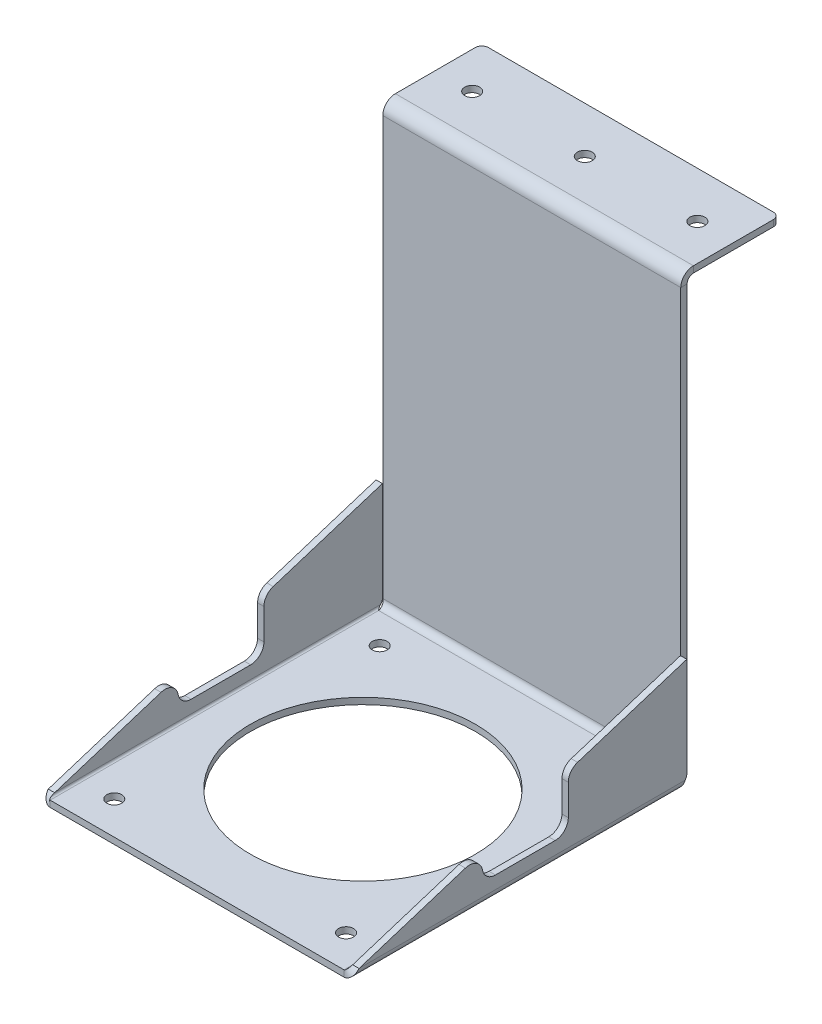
ISO-10303-21;
HEADER;
FILE_DESCRIPTION(('STEP AP214'),'2;1');
FILE_NAME('part.step','',(''),(''),'','','');
FILE_SCHEMA(('AUTOMOTIVE_DESIGN { 1 0 10303 214 1 1 1 1 }'));
ENDSEC;
DATA;
#1=APPLICATION_CONTEXT('core data for automotive mechanical design processes');
#2=APPLICATION_PROTOCOL_DEFINITION('international standard','automotive_design',2000,#1);
#3=PRODUCT_CONTEXT('',#1,'mechanical');
#4=PRODUCT('Part','Part','',(#3));
#5=PRODUCT_RELATED_PRODUCT_CATEGORY('part','',(#4));
#6=PRODUCT_DEFINITION_FORMATION('','',#4);
#7=PRODUCT_DEFINITION_CONTEXT('part definition',#1,'design');
#8=PRODUCT_DEFINITION('design','',#6,#7);
#9=PRODUCT_DEFINITION_SHAPE('','',#8);
#10=(LENGTH_UNIT() NAMED_UNIT(*) SI_UNIT(.MILLI.,.METRE.));
#11=(NAMED_UNIT(*) PLANE_ANGLE_UNIT() SI_UNIT($,.RADIAN.));
#12=(NAMED_UNIT(*) SI_UNIT($,.STERADIAN.) SOLID_ANGLE_UNIT());
#13=UNCERTAINTY_MEASURE_WITH_UNIT(LENGTH_MEASURE(1.E-05),#10,'distance_accuracy_value','');
#14=(GEOMETRIC_REPRESENTATION_CONTEXT(3) GLOBAL_UNCERTAINTY_ASSIGNED_CONTEXT((#13)) GLOBAL_UNIT_ASSIGNED_CONTEXT((#10,
#11,#12)) REPRESENTATION_CONTEXT('',''));
#15=CARTESIAN_POINT('',(0.,0.,0.));
#16=DIRECTION('',(0.,0.,1.));
#17=DIRECTION('',(1.,0.,0.));
#18=AXIS2_PLACEMENT_3D('',#15,#16,#17);
#19=CARTESIAN_POINT('',(-4.76250000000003,0.,0.));
#20=DIRECTION('',(1.,0.,0.));
#21=DIRECTION('',(0.,1.,0.));
#22=AXIS2_PLACEMENT_3D('',#19,#20,#21);
#23=PLANE('',#22);
#24=DIRECTION('',(0.,1.,0.));
#25=VECTOR('',#24,1.);
#26=CARTESIAN_POINT('',(-4.76249999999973,1.11022302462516E-13,-365.429821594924));
#27=LINE('',#26,#25);
#28=CARTESIAN_POINT('',(-4.76249999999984,-31.1150000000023,-365.429821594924));
#29=VERTEX_POINT('',#28);
#30=CARTESIAN_POINT('',(-4.76249999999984,-16.4253503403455,-365.429821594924));
#31=VERTEX_POINT('',#30);
#32=EDGE_CURVE('E1332',#29,#31,#27,.T.);
#33=ORIENTED_EDGE('',*,*,#32,.T.);
#34=CARTESIAN_POINT('',(-4.76249999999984,-16.4253503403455,-371.779821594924));
#35=DIRECTION('',(1.,0.,0.));
#36=DIRECTION('',(0.,1.,0.));
#37=AXIS2_PLACEMENT_3D('',#34,#35,#36);
#38=CIRCLE('',#37,6.35);
#39=CARTESIAN_POINT('',(-4.76249999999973,-10.3720960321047,-369.861329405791));
#40=VERTEX_POINT('',#39);
#41=EDGE_CURVE('E992',#31,#40,#38,.F.);
#42=ORIENTED_EDGE('',*,*,#41,.T.);
#43=DIRECTION('',(0.,0.302124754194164,-0.953268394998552));
#44=VECTOR('',#43,1.);
#45=CARTESIAN_POINT('',(-4.76250000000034,-115.947612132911,-36.7479337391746));
#46=LINE('',#45,#44);
#47=CARTESIAN_POINT('',(-4.76249999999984,6.22299999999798,-422.222416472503));
#48=VERTEX_POINT('',#47);
#49=EDGE_CURVE('E686',#40,#48,#46,.T.);
#50=ORIENTED_EDGE('',*,*,#49,.T.);
#51=DIRECTION('',(0.,1.,0.));
#52=VECTOR('',#51,1.);
#53=CARTESIAN_POINT('',(-4.76249999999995,-43.5769999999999,-422.222416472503));
#54=LINE('',#53,#52);
#55=CARTESIAN_POINT('',(-4.76249999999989,-41.5770000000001,-422.222416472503));
#56=VERTEX_POINT('',#55);
#57=EDGE_CURVE('E1266',#56,#48,#54,.T.);
#58=ORIENTED_EDGE('',*,*,#57,.F.);
#59=CARTESIAN_POINT('',(-4.7625,-43.5769999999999,-421.390646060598));
#60=CARTESIAN_POINT('',(-4.76249999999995,-43.4133650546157,-421.513045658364));
#61=CARTESIAN_POINT('',(-4.7625,-43.0987699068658,-421.748364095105));
#62=CARTESIAN_POINT('',(-4.76250000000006,-42.5950690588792,-422.013331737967));
#63=CARTESIAN_POINT('',(-4.76249999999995,-42.0884440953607,-422.189141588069));
#64=CARTESIAN_POINT('',(-4.76249999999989,-41.7449755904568,-422.211487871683));
#65=CARTESIAN_POINT('',(-4.76249999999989,-41.5770000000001,-422.222416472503));
#66=B_SPLINE_CURVE_WITH_KNOTS('',3,(#59,#60,#61,#62,#63,#64,#65),.UNSPECIFIED.,.F.,.F.,(4,1,1,1,
4),(0.,0.277567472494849,0.533635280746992,0.771921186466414,1.),.UNSPECIFIED.);
#67=CARTESIAN_POINT('',(-4.7625,-43.5769999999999,-421.390646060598));
#68=VERTEX_POINT('',#67);
#69=EDGE_CURVE('E402',#68,#56,#66,.T.);
#70=ORIENTED_EDGE('',*,*,#69,.F.);
#71=DIRECTION('',(0.,0.,-1.));
#72=VECTOR('',#71,1.);
#73=CARTESIAN_POINT('',(-4.76250000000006,-43.5770000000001,-261.937521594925));
#74=LINE('',#73,#72);
#75=CARTESIAN_POINT('',(-4.76249999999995,-43.5770000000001,-265.092736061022));
#76=VERTEX_POINT('',#75);
#77=EDGE_CURVE('E479',#76,#68,#74,.T.);
#78=ORIENTED_EDGE('',*,*,#77,.F.);
#79=CARTESIAN_POINT('',(-4.76249999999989,-27.4093337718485,-316.105190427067));
#80=VERTEX_POINT('',#79);
#81=EDGE_CURVE('E693',#76,#80,#46,.T.);
#82=ORIENTED_EDGE('',*,*,#81,.T.);
#83=CARTESIAN_POINT('',(-4.76249999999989,-33.4625880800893,-318.0236826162));
#84=DIRECTION('',(1.,0.,0.));
#85=DIRECTION('',(0.,1.,0.));
#86=AXIS2_PLACEMENT_3D('',#83,#84,#85);
#87=CIRCLE('',#86,6.35);
#88=CARTESIAN_POINT('',(-4.76249999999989,-32.2887940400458,-324.264252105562));
#89=VERTEX_POINT('',#88);
#90=EDGE_CURVE('E117',#80,#89,#87,.F.);
#91=ORIENTED_EDGE('',*,*,#90,.T.);
#92=CARTESIAN_POINT('',(-4.76249999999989,-31.1150000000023,-330.504821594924));
#93=DIRECTION('',(1.,0.,0.));
#94=DIRECTION('',(0.,1.,0.));
#95=AXIS2_PLACEMENT_3D('',#92,#93,#94);
#96=CIRCLE('',#95,6.35);
#97=CARTESIAN_POINT('',(-4.76249999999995,-37.4650000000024,-330.504821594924));
#98=VERTEX_POINT('',#97);
#99=EDGE_CURVE('E1036',#89,#98,#96,.T.);
#100=ORIENTED_EDGE('',*,*,#99,.T.);
#101=DIRECTION('',(0.,0.,-1.));
#102=VECTOR('',#101,1.);
#103=CARTESIAN_POINT('',(-4.76250000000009,-37.4650000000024,0.));
#104=LINE('',#103,#102);
#105=CARTESIAN_POINT('',(-4.76249999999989,-37.4650000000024,-359.079821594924));
#106=VERTEX_POINT('',#105);
#107=EDGE_CURVE('E1329',#98,#106,#104,.T.);
#108=ORIENTED_EDGE('',*,*,#107,.T.);
#109=CARTESIAN_POINT('',(-4.76249999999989,-31.1150000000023,-359.079821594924));
#110=DIRECTION('',(1.,0.,0.));
#111=DIRECTION('',(0.,1.,0.));
#112=AXIS2_PLACEMENT_3D('',#109,#110,#111);
#113=CIRCLE('',#112,6.35);
#114=EDGE_CURVE('E1032',#106,#29,#113,.T.);
#115=ORIENTED_EDGE('',*,*,#114,.T.);
#116=EDGE_LOOP('',(#33,#42,#50,#58,#70,#78,#82,#91,#100,#108,#115));
#117=FACE_BOUND('',#116,.T.);
#118=ADVANCED_FACE('F97',(#117),#23,.F.);
#119=CARTESIAN_POINT('',(-1.71450000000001,0.,0.));
#120=DIRECTION('',(1.,0.,0.));
#121=DIRECTION('',(0.,1.,0.));
#122=AXIS2_PLACEMENT_3D('',#119,#120,#121);
#123=PLANE('',#122);
#124=DIRECTION('',(0.,0.302124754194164,-0.953268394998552));
#125=VECTOR('',#124,1.);
#126=CARTESIAN_POINT('',(-1.7145000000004,-115.947612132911,-36.7479337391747));
#127=LINE('',#126,#125);
#128=CARTESIAN_POINT('',(-1.71449999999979,-10.3720960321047,-369.861329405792));
#129=VERTEX_POINT('',#128);
#130=CARTESIAN_POINT('',(-1.71449999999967,6.22299999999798,-422.222416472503));
#131=VERTEX_POINT('',#130);
#132=EDGE_CURVE('E692',#129,#131,#127,.T.);
#133=ORIENTED_EDGE('',*,*,#132,.F.);
#134=CARTESIAN_POINT('',(-1.71449999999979,-16.4253503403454,-371.779821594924));
#135=DIRECTION('',(1.,0.,0.));
#136=DIRECTION('',(0.,1.,0.));
#137=AXIS2_PLACEMENT_3D('',#134,#135,#136);
#138=CIRCLE('',#137,6.35);
#139=CARTESIAN_POINT('',(-1.71449999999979,-16.4253503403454,-365.429821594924));
#140=VERTEX_POINT('',#139);
#141=EDGE_CURVE('E1002',#129,#140,#138,.T.);
#142=ORIENTED_EDGE('',*,*,#141,.T.);
#143=DIRECTION('',(0.,1.,0.));
#144=VECTOR('',#143,1.);
#145=CARTESIAN_POINT('',(-1.71449999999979,0.,-365.429821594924));
#146=LINE('',#145,#144);
#147=CARTESIAN_POINT('',(-1.7144999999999,-31.1150000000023,-365.429821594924));
#148=VERTEX_POINT('',#147);
#149=EDGE_CURVE('E1308',#148,#140,#146,.T.);
#150=ORIENTED_EDGE('',*,*,#149,.F.);
#151=CARTESIAN_POINT('',(-1.71449999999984,-31.1150000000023,-359.079821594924));
#152=DIRECTION('',(1.,0.,0.));
#153=DIRECTION('',(0.,1.,0.));
#154=AXIS2_PLACEMENT_3D('',#151,#152,#153);
#155=CIRCLE('',#154,6.35);
#156=CARTESIAN_POINT('',(-1.71449999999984,-37.4650000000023,-359.079821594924));
#157=VERTEX_POINT('',#156);
#158=EDGE_CURVE('E1034',#148,#157,#155,.F.);
#159=ORIENTED_EDGE('',*,*,#158,.T.);
#160=DIRECTION('',(0.,0.,1.));
#161=VECTOR('',#160,1.);
#162=CARTESIAN_POINT('',(-1.71450000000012,-37.4650000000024,0.));
#163=LINE('',#162,#161);
#164=CARTESIAN_POINT('',(-1.7144999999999,-37.4650000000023,-330.504821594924));
#165=VERTEX_POINT('',#164);
#166=EDGE_CURVE('E1302',#165,#157,#163,.F.);
#167=ORIENTED_EDGE('',*,*,#166,.F.);
#168=CARTESIAN_POINT('',(-1.7144999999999,-31.1150000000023,-330.504821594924));
#169=DIRECTION('',(1.,0.,0.));
#170=DIRECTION('',(0.,1.,0.));
#171=AXIS2_PLACEMENT_3D('',#168,#169,#170);
#172=CIRCLE('',#171,6.35);
#173=CARTESIAN_POINT('',(-1.7144999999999,-32.2887940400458,-324.264252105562));
#174=VERTEX_POINT('',#173);
#175=EDGE_CURVE('E1038',#165,#174,#172,.F.);
#176=ORIENTED_EDGE('',*,*,#175,.T.);
#177=CARTESIAN_POINT('',(-1.7144999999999,-33.4625880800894,-318.0236826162));
#178=DIRECTION('',(1.,0.,0.));
#179=DIRECTION('',(0.,1.,0.));
#180=AXIS2_PLACEMENT_3D('',#177,#178,#179);
#181=CIRCLE('',#180,6.35);
#182=CARTESIAN_POINT('',(-1.71449999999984,-27.4093337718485,-316.105190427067));
#183=VERTEX_POINT('',#182);
#184=EDGE_CURVE('E1004',#174,#183,#181,.T.);
#185=ORIENTED_EDGE('',*,*,#184,.T.);
#186=CARTESIAN_POINT('',(-1.71449999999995,-43.5770000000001,-265.092736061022));
#187=VERTEX_POINT('',#186);
#188=EDGE_CURVE('E689',#187,#183,#127,.T.);
#189=ORIENTED_EDGE('',*,*,#188,.F.);
#190=DIRECTION('',(0.,0.,-1.));
#191=VECTOR('',#190,1.);
#192=CARTESIAN_POINT('',(-1.7145000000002,-43.5770000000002,0.));
#193=LINE('',#192,#191);
#194=CARTESIAN_POINT('',(-1.71449999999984,-43.5769999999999,-421.390646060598));
#195=VERTEX_POINT('',#194);
#196=EDGE_CURVE('E467',#187,#195,#193,.T.);
#197=ORIENTED_EDGE('',*,*,#196,.T.);
#198=CARTESIAN_POINT('',(-1.71450000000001,-43.5769999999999,-421.390646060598));
#199=CARTESIAN_POINT('',(-1.71449999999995,-43.4133650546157,-421.513045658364));
#200=CARTESIAN_POINT('',(-1.71449999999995,-43.0987699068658,-421.748364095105));
#201=CARTESIAN_POINT('',(-1.71449999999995,-42.5950690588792,-422.013331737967));
#202=CARTESIAN_POINT('',(-1.71449999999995,-42.0884440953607,-422.189141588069));
#203=CARTESIAN_POINT('',(-1.71449999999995,-41.7449755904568,-422.211487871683));
#204=CARTESIAN_POINT('',(-1.7144999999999,-41.5770000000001,-422.222416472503));
#205=B_SPLINE_CURVE_WITH_KNOTS('',3,(#198,#199,#200,#201,#202,#203,#204),.UNSPECIFIED.,.F.,.F.,
(4,1,1,1,4),(0.,0.277567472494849,0.533635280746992,0.771921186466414,1.),.UNSPECIFIED.);
#206=CARTESIAN_POINT('',(-1.7144999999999,-41.5770000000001,-422.222416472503));
#207=VERTEX_POINT('',#206);
#208=EDGE_CURVE('E463',#195,#207,#205,.T.);
#209=ORIENTED_EDGE('',*,*,#208,.T.);
#210=DIRECTION('',(0.,1.,0.));
#211=VECTOR('',#210,1.);
#212=CARTESIAN_POINT('',(-1.7144999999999,-43.5769999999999,-422.222416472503));
#213=LINE('',#212,#211);
#214=EDGE_CURVE('E413',#207,#131,#213,.T.);
#215=ORIENTED_EDGE('',*,*,#214,.T.);
#216=EDGE_LOOP('',(#133,#142,#150,#159,#167,#176,#185,#189,#197,#209,#215));
#217=FACE_BOUND('',#216,.T.);
#218=ADVANCED_FACE('F439',(#217),#123,.T.);
#219=CARTESIAN_POINT('',(-4.76250000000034,-115.947612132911,-36.7479337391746));
#220=DIRECTION('',(0.,-0.953268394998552,-0.302124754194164));
#221=DIRECTION('',(0.,0.302124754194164,-0.953268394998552));
#222=AXIS2_PLACEMENT_3D('',#219,#220,#221);
#223=PLANE('',#222);
#224=ORIENTED_EDGE('',*,*,#188,.T.);
#225=DIRECTION('',(-1.,0.,0.));
#226=VECTOR('',#225,1.);
#227=CARTESIAN_POINT('',(-4.76249999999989,-27.4093337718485,-316.105190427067));
#228=LINE('',#227,#226);
#229=EDGE_CURVE('E12',#183,#80,#228,.T.);
#230=ORIENTED_EDGE('',*,*,#229,.T.);
#231=ORIENTED_EDGE('',*,*,#81,.F.);
#232=DIRECTION('',(-1.,0.,0.));
#233=VECTOR('',#232,1.);
#234=CARTESIAN_POINT('',(-4.76249999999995,-43.5770000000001,-265.092736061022));
#235=LINE('',#234,#233);
#236=EDGE_CURVE('E691',#76,#187,#235,.F.);
#237=ORIENTED_EDGE('',*,*,#236,.T.);
#238=EDGE_LOOP('',(#224,#230,#231,#237));
#239=FACE_BOUND('',#238,.T.);
#240=ADVANCED_FACE('F647',(#239),#223,.F.);
#241=ORIENTED_EDGE('',*,*,#49,.F.);
#242=DIRECTION('',(-1.,0.,0.));
#243=VECTOR('',#242,1.);
#244=CARTESIAN_POINT('',(-4.76249999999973,-10.3720960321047,-369.861329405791));
#245=LINE('',#244,#243);
#246=EDGE_CURVE('E995',#40,#129,#245,.F.);
#247=ORIENTED_EDGE('',*,*,#246,.T.);
#248=ORIENTED_EDGE('',*,*,#132,.T.);
#249=DIRECTION('',(-1.,0.,0.));
#250=VECTOR('',#249,1.);
#251=CARTESIAN_POINT('',(-1.71449999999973,6.22299999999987,-422.222416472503));
#252=LINE('',#251,#250);
#253=EDGE_CURVE('E815',#131,#48,#252,.T.);
#254=ORIENTED_EDGE('',*,*,#253,.T.);
#255=EDGE_LOOP('',(#241,#247,#248,#254));
#256=FACE_BOUND('',#255,.T.);
#257=ADVANCED_FACE('F664',(#256),#223,.F.);
#258=CARTESIAN_POINT('',(-147.6375,-7.7715611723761E-13,0.));
#259=DIRECTION('',(1.,0.,0.));
#260=DIRECTION('',(0.,1.,0.));
#261=AXIS2_PLACEMENT_3D('',#258,#259,#260);
#262=PLANE('',#261);
#263=CARTESIAN_POINT('',(-147.6375,-31.1150000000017,-330.504821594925));
#264=DIRECTION('',(1.,0.,0.));
#265=DIRECTION('',(0.,1.,0.));
#266=AXIS2_PLACEMENT_3D('',#263,#264,#265);
#267=CIRCLE('',#266,6.35);
#268=CARTESIAN_POINT('',(-147.6375,-37.4650000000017,-330.504821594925));
#269=VERTEX_POINT('',#268);
#270=CARTESIAN_POINT('',(-147.6375,-32.2887940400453,-324.264252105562));
#271=VERTEX_POINT('',#270);
#272=EDGE_CURVE('E1027',#269,#271,#267,.F.);
#273=ORIENTED_EDGE('',*,*,#272,.T.);
#274=CARTESIAN_POINT('',(-147.6375,-33.4625880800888,-318.0236826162));
#275=DIRECTION('',(1.,0.,0.));
#276=DIRECTION('',(0.,1.,0.));
#277=AXIS2_PLACEMENT_3D('',#274,#275,#276);
#278=CIRCLE('',#277,6.35);
#279=CARTESIAN_POINT('',(-147.6375,-27.4093337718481,-316.105190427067));
#280=VERTEX_POINT('',#279);
#281=EDGE_CURVE('E1012',#271,#280,#278,.T.);
#282=ORIENTED_EDGE('',*,*,#281,.T.);
#283=DIRECTION('',(0.,0.302124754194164,-0.953268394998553));
#284=VECTOR('',#283,1.);
#285=CARTESIAN_POINT('',(-147.6375,-115.947612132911,-36.7479337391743));
#286=LINE('',#285,#284);
#287=CARTESIAN_POINT('',(-147.6375,-43.5770000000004,-265.09273606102));
#288=VERTEX_POINT('',#287);
#289=EDGE_CURVE('E678',#288,#280,#286,.T.);
#290=ORIENTED_EDGE('',*,*,#289,.F.);
#291=DIRECTION('',(0.,0.,1.));
#292=VECTOR('',#291,1.);
#293=CARTESIAN_POINT('',(-147.6375,-43.5770000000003,-419.402021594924));
#294=LINE('',#293,#292);
#295=CARTESIAN_POINT('',(-147.6375,-43.5770000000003,-421.390646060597));
#296=VERTEX_POINT('',#295);
#297=EDGE_CURVE('E386',#296,#288,#294,.T.);
#298=ORIENTED_EDGE('',*,*,#297,.F.);
#299=CARTESIAN_POINT('',(-147.6375,-43.5770000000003,-421.390646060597));
#300=CARTESIAN_POINT('',(-147.6375,-43.4133650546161,-421.513045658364));
#301=CARTESIAN_POINT('',(-147.6375,-43.0987699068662,-421.748364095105));
#302=CARTESIAN_POINT('',(-147.6375,-42.5950690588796,-422.013331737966));
#303=CARTESIAN_POINT('',(-147.6375,-42.0884440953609,-422.18914158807));
#304=CARTESIAN_POINT('',(-147.6375,-41.7449755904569,-422.211487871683));
#305=CARTESIAN_POINT('',(-147.6375,-41.5770000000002,-422.222416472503));
#306=B_SPLINE_CURVE_WITH_KNOTS('',3,(#299,#300,#301,#302,#303,#304,#305),.UNSPECIFIED.,.F.,.F.,
(4,1,1,1,4),(0.,0.27756747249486,0.533635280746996,0.771921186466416,1.),.UNSPECIFIED.);
#307=CARTESIAN_POINT('',(-147.6375,-41.5770000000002,-422.222416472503));
#308=VERTEX_POINT('',#307);
#309=EDGE_CURVE('E1252',#296,#308,#306,.T.);
#310=ORIENTED_EDGE('',*,*,#309,.T.);
#311=DIRECTION('',(0.,1.,0.));
#312=VECTOR('',#311,1.);
#313=CARTESIAN_POINT('',(-147.6375,-43.5770000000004,-422.222416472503));
#314=LINE('',#313,#312);
#315=CARTESIAN_POINT('',(-147.6375,6.22299999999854,-422.222416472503));
#316=VERTEX_POINT('',#315);
#317=EDGE_CURVE('E1262',#308,#316,#314,.T.);
#318=ORIENTED_EDGE('',*,*,#317,.T.);
#319=CARTESIAN_POINT('',(-147.6375,-10.3720960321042,-369.861329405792));
#320=VERTEX_POINT('',#319);
#321=EDGE_CURVE('E682',#320,#316,#286,.T.);
#322=ORIENTED_EDGE('',*,*,#321,.F.);
#323=CARTESIAN_POINT('',(-147.6375,-16.425350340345,-371.779821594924));
#324=DIRECTION('',(1.,0.,0.));
#325=DIRECTION('',(0.,1.,0.));
#326=AXIS2_PLACEMENT_3D('',#323,#324,#325);
#327=CIRCLE('',#326,6.35);
#328=CARTESIAN_POINT('',(-147.6375,-16.425350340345,-365.429821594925));
#329=VERTEX_POINT('',#328);
#330=EDGE_CURVE('E1014',#320,#329,#327,.T.);
#331=ORIENTED_EDGE('',*,*,#330,.T.);
#332=DIRECTION('',(0.,1.,0.));
#333=VECTOR('',#332,1.);
#334=CARTESIAN_POINT('',(-147.6375,-7.7715611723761E-13,-365.429821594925));
#335=LINE('',#334,#333);
#336=CARTESIAN_POINT('',(-147.6375,-31.1150000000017,-365.429821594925));
#337=VERTEX_POINT('',#336);
#338=EDGE_CURVE('E1301',#337,#329,#335,.T.);
#339=ORIENTED_EDGE('',*,*,#338,.F.);
#340=CARTESIAN_POINT('',(-147.6375,-31.1150000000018,-359.079821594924));
#341=DIRECTION('',(1.,0.,0.));
#342=DIRECTION('',(0.,1.,0.));
#343=AXIS2_PLACEMENT_3D('',#340,#341,#342);
#344=CIRCLE('',#343,6.35);
#345=CARTESIAN_POINT('',(-147.6375,-37.4650000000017,-359.079821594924));
#346=VERTEX_POINT('',#345);
#347=EDGE_CURVE('E1023',#337,#346,#344,.F.);
#348=ORIENTED_EDGE('',*,*,#347,.T.);
#349=DIRECTION('',(0.,0.,-1.));
#350=VECTOR('',#349,1.);
#351=CARTESIAN_POINT('',(-147.6375,-37.4650000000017,0.));
#352=LINE('',#351,#350);
#353=EDGE_CURVE('E1296',#269,#346,#352,.T.);
#354=ORIENTED_EDGE('',*,*,#353,.F.);
#355=EDGE_LOOP('',(#273,#282,#290,#298,#310,#318,#322,#331,#339,#348,#354));
#356=FACE_BOUND('',#355,.T.);
#357=ADVANCED_FACE('F655',(#356),#262,.T.);
#358=CARTESIAN_POINT('',(-150.6855,-7.7715611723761E-13,0.));
#359=DIRECTION('',(1.,0.,0.));
#360=DIRECTION('',(0.,1.,0.));
#361=AXIS2_PLACEMENT_3D('',#358,#359,#360);
#362=PLANE('',#361);
#363=DIRECTION('',(0.,0.302124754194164,-0.953268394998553));
#364=VECTOR('',#363,1.);
#365=CARTESIAN_POINT('',(-150.6855,-115.947612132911,-36.7479337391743));
#366=LINE('',#365,#364);
#367=CARTESIAN_POINT('',(-150.6855,-43.5770000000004,-265.09273606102));
#368=VERTEX_POINT('',#367);
#369=CARTESIAN_POINT('',(-150.6855,-27.4093337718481,-316.105190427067));
#370=VERTEX_POINT('',#369);
#371=EDGE_CURVE('E668',#368,#370,#366,.T.);
#372=ORIENTED_EDGE('',*,*,#371,.T.);
#373=CARTESIAN_POINT('',(-150.6855,-33.4625880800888,-318.0236826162));
#374=DIRECTION('',(1.,0.,0.));
#375=DIRECTION('',(0.,1.,0.));
#376=AXIS2_PLACEMENT_3D('',#373,#374,#375);
#377=CIRCLE('',#376,6.35);
#378=CARTESIAN_POINT('',(-150.6855,-32.2887940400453,-324.264252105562));
#379=VERTEX_POINT('',#378);
#380=EDGE_CURVE('E669',#370,#379,#377,.F.);
#381=ORIENTED_EDGE('',*,*,#380,.T.);
#382=CARTESIAN_POINT('',(-150.6855,-31.1150000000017,-330.504821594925));
#383=DIRECTION('',(1.,0.,0.));
#384=DIRECTION('',(0.,1.,0.));
#385=AXIS2_PLACEMENT_3D('',#382,#383,#384);
#386=CIRCLE('',#385,6.35);
#387=CARTESIAN_POINT('',(-150.6855,-37.4650000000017,-330.504821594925));
#388=VERTEX_POINT('',#387);
#389=EDGE_CURVE('E1030',#379,#388,#386,.T.);
#390=ORIENTED_EDGE('',*,*,#389,.T.);
#391=DIRECTION('',(0.,0.,1.));
#392=VECTOR('',#391,1.);
#393=CARTESIAN_POINT('',(-150.6855,-37.4650000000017,0.));
#394=LINE('',#393,#392);
#395=CARTESIAN_POINT('',(-150.6855,-37.4650000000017,-359.079821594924));
#396=VERTEX_POINT('',#395);
#397=EDGE_CURVE('E1305',#388,#396,#394,.F.);
#398=ORIENTED_EDGE('',*,*,#397,.T.);
#399=CARTESIAN_POINT('',(-150.6855,-31.1150000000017,-359.079821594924));
#400=DIRECTION('',(1.,0.,0.));
#401=DIRECTION('',(0.,1.,0.));
#402=AXIS2_PLACEMENT_3D('',#399,#400,#401);
#403=CIRCLE('',#402,6.35);
#404=CARTESIAN_POINT('',(-150.6855,-31.1150000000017,-365.429821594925));
#405=VERTEX_POINT('',#404);
#406=EDGE_CURVE('E1025',#396,#405,#403,.T.);
#407=ORIENTED_EDGE('',*,*,#406,.T.);
#408=DIRECTION('',(0.,1.,0.));
#409=VECTOR('',#408,1.);
#410=CARTESIAN_POINT('',(-150.6855,-7.7715611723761E-13,-365.429821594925));
#411=LINE('',#410,#409);
#412=CARTESIAN_POINT('',(-150.6855,-16.425350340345,-365.429821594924));
#413=VERTEX_POINT('',#412);
#414=EDGE_CURVE('E387',#405,#413,#411,.T.);
#415=ORIENTED_EDGE('',*,*,#414,.T.);
#416=CARTESIAN_POINT('',(-150.6855,-16.425350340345,-371.779821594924));
#417=DIRECTION('',(1.,0.,0.));
#418=DIRECTION('',(0.,1.,0.));
#419=AXIS2_PLACEMENT_3D('',#416,#417,#418);
#420=CIRCLE('',#419,6.35);
#421=CARTESIAN_POINT('',(-150.6855,-10.3720960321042,-369.861329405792));
#422=VERTEX_POINT('',#421);
#423=EDGE_CURVE('E1019',#413,#422,#420,.F.);
#424=ORIENTED_EDGE('',*,*,#423,.T.);
#425=CARTESIAN_POINT('',(-150.6855,6.22299999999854,-422.222416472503));
#426=VERTEX_POINT('',#425);
#427=EDGE_CURVE('E674',#422,#426,#366,.T.);
#428=ORIENTED_EDGE('',*,*,#427,.T.);
#429=DIRECTION('',(0.,1.,0.));
#430=VECTOR('',#429,1.);
#431=CARTESIAN_POINT('',(-150.6855,-43.5770000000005,-422.222416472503));
#432=LINE('',#431,#430);
#433=CARTESIAN_POINT('',(-150.6855,-41.5770000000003,-422.222416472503));
#434=VERTEX_POINT('',#433);
#435=EDGE_CURVE('E1246',#434,#426,#432,.T.);
#436=ORIENTED_EDGE('',*,*,#435,.F.);
#437=CARTESIAN_POINT('',(-150.6855,-43.5770000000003,-421.390646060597));
#438=CARTESIAN_POINT('',(-150.6855,-43.4133650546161,-421.513045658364));
#439=CARTESIAN_POINT('',(-150.6855,-43.0987699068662,-421.748364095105));
#440=CARTESIAN_POINT('',(-150.6855,-42.5950690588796,-422.013331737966));
#441=CARTESIAN_POINT('',(-150.6855,-42.0884440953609,-422.18914158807));
#442=CARTESIAN_POINT('',(-150.6855,-41.7449755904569,-422.211487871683));
#443=CARTESIAN_POINT('',(-150.6855,-41.5770000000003,-422.222416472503));
#444=B_SPLINE_CURVE_WITH_KNOTS('',3,(#437,#438,#439,#440,#441,#442,#443),.UNSPECIFIED.,.F.,.F.,
(4,1,1,1,4),(0.,0.27756747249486,0.533635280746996,0.771921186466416,1.),.UNSPECIFIED.);
#445=CARTESIAN_POINT('',(-150.6855,-43.5770000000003,-421.390646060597));
#446=VERTEX_POINT('',#445);
#447=EDGE_CURVE('E404',#446,#434,#444,.T.);
#448=ORIENTED_EDGE('',*,*,#447,.F.);
#449=DIRECTION('',(0.,0.,-1.));
#450=VECTOR('',#449,1.);
#451=CARTESIAN_POINT('',(-150.6855,-43.5770000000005,0.));
#452=LINE('',#451,#450);
#453=EDGE_CURVE('E485',#368,#446,#452,.T.);
#454=ORIENTED_EDGE('',*,*,#453,.F.);
#455=EDGE_LOOP('',(#372,#381,#390,#398,#407,#415,#424,#428,#436,#448,#454));
#456=FACE_BOUND('',#455,.T.);
#457=ADVANCED_FACE('F652',(#456),#362,.F.);
#458=CARTESIAN_POINT('',(-147.6375,-115.947612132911,-36.7479337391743));
#459=DIRECTION('',(0.,-0.953268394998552,-0.302124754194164));
#460=DIRECTION('',(0.,0.302124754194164,-0.953268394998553));
#461=AXIS2_PLACEMENT_3D('',#458,#459,#460);
#462=PLANE('',#461);
#463=ORIENTED_EDGE('',*,*,#289,.T.);
#464=DIRECTION('',(1.,0.,0.));
#465=VECTOR('',#464,1.);
#466=CARTESIAN_POINT('',(-150.6855,-27.4093337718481,-316.105190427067));
#467=LINE('',#466,#465);
#468=EDGE_CURVE('E1021',#280,#370,#467,.F.);
#469=ORIENTED_EDGE('',*,*,#468,.T.);
#470=ORIENTED_EDGE('',*,*,#371,.F.);
#471=DIRECTION('',(1.,0.,0.));
#472=VECTOR('',#471,1.);
#473=CARTESIAN_POINT('',(-147.6375,-43.5770000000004,-265.09273606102));
#474=LINE('',#473,#472);
#475=EDGE_CURVE('E673',#288,#368,#474,.F.);
#476=ORIENTED_EDGE('',*,*,#475,.F.);
#477=EDGE_LOOP('',(#463,#469,#470,#476));
#478=FACE_BOUND('',#477,.T.);
#479=ADVANCED_FACE('F654',(#478),#462,.F.);
#480=ORIENTED_EDGE('',*,*,#427,.F.);
#481=DIRECTION('',(1.,0.,0.));
#482=VECTOR('',#481,1.);
#483=CARTESIAN_POINT('',(-147.6375,-10.3720960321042,-369.861329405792));
#484=LINE('',#483,#482);
#485=EDGE_CURVE('E1007',#422,#320,#484,.T.);
#486=ORIENTED_EDGE('',*,*,#485,.T.);
#487=ORIENTED_EDGE('',*,*,#321,.T.);
#488=DIRECTION('',(1.,0.,0.));
#489=VECTOR('',#488,1.);
#490=CARTESIAN_POINT('',(-150.6855,6.22299999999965,-422.222416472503));
#491=LINE('',#490,#489);
#492=EDGE_CURVE('E1249',#426,#316,#491,.T.);
#493=ORIENTED_EDGE('',*,*,#492,.F.);
#494=EDGE_LOOP('',(#480,#486,#487,#493));
#495=FACE_BOUND('',#494,.T.);
#496=ADVANCED_FACE('F661',(#495),#462,.F.);
#497=CARTESIAN_POINT('',(-146.6375,-43.5770000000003,-501.183390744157));
#498=DIRECTION('',(0.,0.,1.));
#499=DIRECTION('',(0.,-1.,0.));
#500=AXIS2_PLACEMENT_3D('',#497,#498,#499);
#501=CYLINDRICAL_SURFACE('',#500,1.);
#502=CARTESIAN_POINT('',(-146.6375,-43.5770000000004,-265.09273606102));
#503=DIRECTION('',(0.,-0.953268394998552,-0.302124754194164));
#504=DIRECTION('',(0.,-0.302124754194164,0.953268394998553));
#505=AXIS2_PLACEMENT_3D('',#502,#503,#504);
#506=ELLIPSE('',#505,3.30989098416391,1.);
#507=CARTESIAN_POINT('',(-146.6375,-44.5770000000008,-261.937521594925));
#508=VERTEX_POINT('',#507);
#509=EDGE_CURVE('E366',#288,#508,#506,.F.);
#510=ORIENTED_EDGE('',*,*,#509,.T.);
#511=DIRECTION('',(0.,0.,-1.));
#512=VECTOR('',#511,1.);
#513=CARTESIAN_POINT('',(-146.6375,-44.5770000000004,-261.937521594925));
#514=LINE('',#513,#512);
#515=CARTESIAN_POINT('',(-146.6375,-44.5770000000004,-419.402021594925));
#516=VERTEX_POINT('',#515);
#517=EDGE_CURVE('E383',#508,#516,#514,.T.);
#518=ORIENTED_EDGE('',*,*,#517,.T.);
#519=CARTESIAN_POINT('',(-147.6375,-43.5770000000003,-421.390646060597));
#520=CARTESIAN_POINT('',(-147.637521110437,-43.6225075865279,-421.333031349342));
#521=CARTESIAN_POINT('',(-147.634394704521,-43.6680133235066,-421.275418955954));
#522=CARTESIAN_POINT('',(-147.621996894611,-43.7581765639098,-421.160202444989));
#523=CARTESIAN_POINT('',(-147.612726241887,-43.8028341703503,-421.102598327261));
#524=CARTESIAN_POINT('',(-147.588231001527,-43.8903213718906,-420.987580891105));
#525=CARTESIAN_POINT('',(-147.573026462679,-43.9331565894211,-420.930167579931));
#526=CARTESIAN_POINT('',(-147.536950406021,-44.0163683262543,-420.815343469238));
#527=CARTESIAN_POINT('',(-147.516079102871,-44.056744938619,-420.757932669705));
#528=CARTESIAN_POINT('',(-147.468927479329,-44.1345002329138,-420.642811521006));
#529=CARTESIAN_POINT('',(-147.442619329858,-44.1718620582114,-420.585101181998));
#530=CARTESIAN_POINT('',(-147.385144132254,-44.242663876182,-420.469650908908));
#531=CARTESIAN_POINT('',(-147.353974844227,-44.2761020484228,-420.411910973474));
#532=CARTESIAN_POINT('',(-147.287377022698,-44.3384055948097,-420.296451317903));
#533=CARTESIAN_POINT('',(-147.251949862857,-44.3672724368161,-420.23873159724));
#534=CARTESIAN_POINT('',(-147.177505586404,-44.4198940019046,-420.123320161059));
#535=CARTESIAN_POINT('',(-147.138490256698,-44.4436512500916,-420.065628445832));
#536=CARTESIAN_POINT('',(-147.06268003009,-44.4829855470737,-419.95750299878));
#537=CARTESIAN_POINT('',(-147.026222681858,-44.4992155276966,-419.907068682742));
#538=CARTESIAN_POINT('',(-146.951634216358,-44.5272139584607,-419.806203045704));
#539=CARTESIAN_POINT('',(-146.913503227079,-44.5389827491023,-419.75577172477));
#540=CARTESIAN_POINT('',(-146.836017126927,-44.5579095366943,-419.654792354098));
#541=CARTESIAN_POINT('',(-146.796659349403,-44.5650566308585,-419.604244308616));
#542=CARTESIAN_POINT('',(-146.717367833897,-44.5746084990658,-419.503138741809));
#543=CARTESIAN_POINT('',(-146.677434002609,-44.5770124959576,-419.452581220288));
#544=CARTESIAN_POINT('',(-146.6375,-44.5770000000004,-419.402021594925));
#545=B_SPLINE_CURVE_WITH_KNOTS('',3,(#519,#520,#521,#522,#523,#524,#525,#526,#527,#528,#529,
#530,#531,#532,#533,#534,#535,#536,#537,#538,#539,#540,#541,#542,#543,#544),.UNSPECIFIED.,.F.,
.F.,(4,2,2,2,2,2,2,2,2,2,2,2,4),(0.,0.220187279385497,0.440347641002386,0.659770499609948,
0.879185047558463,1.09975181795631,1.32042052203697,1.54101822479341,1.76150665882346,
1.95427400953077,2.14702664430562,2.34023234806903,2.53346970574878),.UNSPECIFIED.);
#546=EDGE_CURVE('E1207',#296,#516,#545,.T.);
#547=ORIENTED_EDGE('',*,*,#546,.F.);
#548=ORIENTED_EDGE('',*,*,#297,.T.);
#549=EDGE_LOOP('',(#510,#518,#547,#548));
#550=FACE_BOUND('',#549,.T.);
#551=ADVANCED_FACE('F380',(#550),#501,.F.);
#552=CARTESIAN_POINT('',(-146.6375,-43.5770000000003,-501.183390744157));
#553=DIRECTION('',(0.,0.,1.));
#554=DIRECTION('',(0.,-1.,0.));
#555=AXIS2_PLACEMENT_3D('',#552,#553,#554);
#556=CYLINDRICAL_SURFACE('',#555,4.048);
#557=DIRECTION('',(0.,0.,-1.));
#558=VECTOR('',#557,1.);
#559=CARTESIAN_POINT('',(-146.6375,-47.6250000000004,-261.937521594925));
#560=LINE('',#559,#558);
#561=CARTESIAN_POINT('',(-146.6375,-47.6250000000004,-261.937521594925));
#562=VERTEX_POINT('',#561);
#563=CARTESIAN_POINT('',(-146.6375,-47.6250000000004,-419.402021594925));
#564=VERTEX_POINT('',#563);
#565=EDGE_CURVE('E577',#562,#564,#560,.T.);
#566=ORIENTED_EDGE('',*,*,#565,.F.);
#567=CARTESIAN_POINT('',(-146.6375,-43.5770000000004,-265.09273606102));
#568=DIRECTION('',(0.,-0.614762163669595,-0.788712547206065));
#569=DIRECTION('',(0.,-0.788712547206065,0.614762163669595));
#570=AXIS2_PLACEMENT_3D('',#567,#568,#569);
#571=ELLIPSE('',#570,5.13241486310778,4.048);
#572=EDGE_CURVE('E369',#368,#562,#571,.F.);
#573=ORIENTED_EDGE('',*,*,#572,.F.);
#574=ORIENTED_EDGE('',*,*,#453,.T.);
#575=CARTESIAN_POINT('',(-150.6855,-43.5770000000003,-421.390646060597));
#576=CARTESIAN_POINT('',(-150.685517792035,-43.7019038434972,-421.351580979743));
#577=CARTESIAN_POINT('',(-150.679719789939,-43.8268054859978,-421.312517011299));
#578=CARTESIAN_POINT('',(-150.656619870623,-44.0755386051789,-421.234391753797));
#579=CARTESIAN_POINT('',(-150.639318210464,-44.1993701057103,-421.195330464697));
#580=CARTESIAN_POINT('',(-150.593367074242,-44.444751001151,-421.117257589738));
#581=CARTESIAN_POINT('',(-150.564731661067,-44.5663030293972,-421.078246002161));
#582=CARTESIAN_POINT('',(-150.49636446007,-44.8062377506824,-421.000221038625));
#583=CARTESIAN_POINT('',(-150.456633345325,-44.9246206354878,-420.961207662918));
#584=CARTESIAN_POINT('',(-150.368387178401,-45.1521239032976,-420.884888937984));
#585=CARTESIAN_POINT('',(-150.320332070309,-45.2614229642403,-420.847583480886));
#586=CARTESIAN_POINT('',(-150.214740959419,-45.4753909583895,-420.772959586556));
#587=CARTESIAN_POINT('',(-150.157201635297,-45.5800582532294,-420.735641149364));
#588=CARTESIAN_POINT('',(-150.033146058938,-45.7838327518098,-420.661032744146));
#589=CARTESIAN_POINT('',(-149.966635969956,-45.88294370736,-420.623742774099));
#590=CARTESIAN_POINT('',(-149.825104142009,-46.0749416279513,-420.549146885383));
#591=CARTESIAN_POINT('',(-149.750079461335,-46.1678264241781,-420.511840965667));
#592=CARTESIAN_POINT('',(-149.592142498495,-46.3465871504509,-420.437238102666));
#593=CARTESIAN_POINT('',(-149.509232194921,-46.4324648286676,-420.399941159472));
#594=CARTESIAN_POINT('',(-149.336155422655,-46.5965668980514,-420.32534662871));
#595=CARTESIAN_POINT('',(-149.24598895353,-46.6747912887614,-420.288049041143));
#596=CARTESIAN_POINT('',(-149.059046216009,-46.8230216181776,-420.213434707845));
#597=CARTESIAN_POINT('',(-148.962265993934,-46.8930225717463,-420.176117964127));
#598=CARTESIAN_POINT('',(-148.762936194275,-47.0241805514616,-420.101496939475));
#599=CARTESIAN_POINT('',(-148.660388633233,-47.0853406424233,-420.064192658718));
#600=CARTESIAN_POINT('',(-148.450210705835,-47.1984134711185,-419.989551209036));
#601=CARTESIAN_POINT('',(-148.342576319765,-47.2503187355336,-419.952214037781));
#602=CARTESIAN_POINT('',(-148.123182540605,-47.3443985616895,-419.877554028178));
#603=CARTESIAN_POINT('',(-148.011424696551,-47.3865767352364,-419.840231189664));
#604=CARTESIAN_POINT('',(-147.784725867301,-47.460863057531,-419.765621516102));
#605=CARTESIAN_POINT('',(-147.669787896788,-47.4929804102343,-419.728334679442));
#606=CARTESIAN_POINT('',(-147.437568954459,-47.5469364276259,-419.653777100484));
#607=CARTESIAN_POINT('',(-147.320289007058,-47.5687794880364,-419.616506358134));
#608=CARTESIAN_POINT('',(-147.108684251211,-47.5985948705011,-419.549675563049));
#609=CARTESIAN_POINT('',(-147.014627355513,-47.6085014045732,-419.520114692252));
#610=CARTESIAN_POINT('',(-146.826215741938,-47.621700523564,-419.461043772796));
#611=CARTESIAN_POINT('',(-146.731861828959,-47.6250046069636,-419.431533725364));
#612=CARTESIAN_POINT('',(-146.6375,-47.6250000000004,-419.402021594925));
#613=B_SPLINE_CURVE_WITH_KNOTS('',3,(#575,#576,#577,#578,#579,#580,#581,#582,#583,#584,#585,
#586,#587,#588,#589,#590,#591,#592,#593,#594,#595,#596,#597,#598,#599,#600,#601,#602,#603,#604,
#605,#606,#607,#608,#609,#610,#611,#612),.UNSPECIFIED.,.F.,.F.,(4,2,2,2,2,2,2,2,2,2,2,2,2,2,2,2,
2,2,4),(0.,0.392479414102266,0.78495005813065,1.17693524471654,1.56889665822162,
1.94372258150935,2.31868004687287,2.6933812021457,3.06821220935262,3.44294941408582,
3.81768664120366,4.19264987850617,4.56748281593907,4.94261707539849,5.31761181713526,
5.69226249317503,6.06675273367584,6.36380699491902,6.66034346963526),.UNSPECIFIED.);
#614=EDGE_CURVE('E394',#446,#564,#613,.T.);
#615=ORIENTED_EDGE('',*,*,#614,.T.);
#616=EDGE_LOOP('',(#566,#573,#574,#615));
#617=FACE_BOUND('',#616,.T.);
#618=ADVANCED_FACE('F1217',(#617),#556,.T.);
#619=CARTESIAN_POINT('',(-5.7625,-43.5770000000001,-182.144776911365));
#620=DIRECTION('',(0.,0.,-1.));
#621=DIRECTION('',(-1.,0.,0.));
#622=AXIS2_PLACEMENT_3D('',#619,#620,#621);
#623=CYLINDRICAL_SURFACE('',#622,1.);
#624=CARTESIAN_POINT('',(-5.7625,-43.5770000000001,-265.092736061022));
#625=DIRECTION('',(0.,-0.953268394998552,-0.302124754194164));
#626=DIRECTION('',(0.,0.302124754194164,-0.953268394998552));
#627=AXIS2_PLACEMENT_3D('',#624,#625,#626);
#628=ELLIPSE('',#627,3.30989098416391,1.);
#629=CARTESIAN_POINT('',(-5.76249999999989,-44.5770000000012,-261.937521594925));
#630=VERTEX_POINT('',#629);
#631=EDGE_CURVE('E676',#630,#76,#628,.F.);
#632=ORIENTED_EDGE('',*,*,#631,.T.);
#633=ORIENTED_EDGE('',*,*,#77,.T.);
#634=CARTESIAN_POINT('',(-5.76250000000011,-44.577,-419.402021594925));
#635=CARTESIAN_POINT('',(-5.71699241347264,-44.5770211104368,-419.459636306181));
#636=CARTESIAN_POINT('',(-5.67148667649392,-44.5738947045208,-419.517248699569));
#637=CARTESIAN_POINT('',(-5.58132343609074,-44.5614968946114,-419.632465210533));
#638=CARTESIAN_POINT('',(-5.53666582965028,-44.5522262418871,-419.690069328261));
#639=CARTESIAN_POINT('',(-5.44917862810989,-44.5277310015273,-419.805086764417));
#640=CARTESIAN_POINT('',(-5.40634341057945,-44.5125264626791,-419.862500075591));
#641=CARTESIAN_POINT('',(-5.32313167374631,-44.4764504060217,-419.977324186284));
#642=CARTESIAN_POINT('',(-5.28275506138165,-44.4555791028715,-420.034734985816));
#643=CARTESIAN_POINT('',(-5.20499976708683,-44.4084274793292,-420.149856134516));
#644=CARTESIAN_POINT('',(-5.16763794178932,-44.3821193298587,-420.207566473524));
#645=CARTESIAN_POINT('',(-5.09683612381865,-44.3246441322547,-420.323016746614));
#646=CARTESIAN_POINT('',(-5.06339795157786,-44.2934748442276,-420.380756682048));
#647=CARTESIAN_POINT('',(-5.00109440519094,-44.2268770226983,-420.496216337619));
#648=CARTESIAN_POINT('',(-4.97222756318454,-44.1914498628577,-420.553936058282));
#649=CARTESIAN_POINT('',(-4.9196059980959,-44.1170055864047,-420.669347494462));
#650=CARTESIAN_POINT('',(-4.8958487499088,-44.0779902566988,-420.727039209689));
#651=CARTESIAN_POINT('',(-4.8565144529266,-44.00218003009,-420.835164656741));
#652=CARTESIAN_POINT('',(-4.84028447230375,-43.9657226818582,-420.88559897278));
#653=CARTESIAN_POINT('',(-4.8122860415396,-43.8911342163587,-420.986464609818));
#654=CARTESIAN_POINT('',(-4.80051725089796,-43.8530032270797,-421.036895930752));
#655=CARTESIAN_POINT('',(-4.78159046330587,-43.7755171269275,-421.137875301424));
#656=CARTESIAN_POINT('',(-4.7744433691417,-43.7361593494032,-421.188423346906));
#657=CARTESIAN_POINT('',(-4.76489150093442,-43.6568678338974,-421.289528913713));
#658=CARTESIAN_POINT('',(-4.76248750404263,-43.6169340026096,-421.340086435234));
#659=CARTESIAN_POINT('',(-4.76249999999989,-43.5770000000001,-421.390646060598));
#660=B_SPLINE_CURVE_WITH_KNOTS('',3,(#634,#635,#636,#637,#638,#639,#640,#641,#642,#643,#644,
#645,#646,#647,#648,#649,#650,#651,#652,#653,#654,#655,#656,#657,#658,#659),.UNSPECIFIED.,.F.,
.F.,(4,2,2,2,2,2,2,2,2,2,2,2,4),(0.,0.220187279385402,0.440347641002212,0.659770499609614,
0.879185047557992,1.09975181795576,1.32042052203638,1.54101822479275,1.76150665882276,
1.95427400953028,2.14702664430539,2.34023234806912,2.53346970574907),.UNSPECIFIED.);
#661=CARTESIAN_POINT('',(-5.76250000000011,-44.5770000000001,-419.402021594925));
#662=VERTEX_POINT('',#661);
#663=EDGE_CURVE('E374',#662,#68,#660,.T.);
#664=ORIENTED_EDGE('',*,*,#663,.F.);
#665=DIRECTION('',(0.,0.,1.));
#666=VECTOR('',#665,1.);
#667=CARTESIAN_POINT('',(-5.76249999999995,-44.577,-419.402021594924));
#668=LINE('',#667,#666);
#669=EDGE_CURVE('E484',#662,#630,#668,.T.);
#670=ORIENTED_EDGE('',*,*,#669,.T.);
#671=EDGE_LOOP('',(#632,#633,#664,#670));
#672=FACE_BOUND('',#671,.T.);
#673=ADVANCED_FACE('F1215',(#672),#623,.F.);
#674=CARTESIAN_POINT('',(-5.7625,-43.5770000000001,-182.144776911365));
#675=DIRECTION('',(0.,0.,-1.));
#676=DIRECTION('',(-1.,0.,0.));
#677=AXIS2_PLACEMENT_3D('',#674,#675,#676);
#678=CYLINDRICAL_SURFACE('',#677,4.048);
#679=ORIENTED_EDGE('',*,*,#196,.F.);
#680=CARTESIAN_POINT('',(-5.7625,-43.5770000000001,-265.092736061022));
#681=DIRECTION('',(0.,-0.614762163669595,-0.788712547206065));
#682=DIRECTION('',(0.,0.788712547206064,-0.614762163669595));
#683=AXIS2_PLACEMENT_3D('',#680,#681,#682);
#684=ELLIPSE('',#683,5.13241486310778,4.048);
#685=CARTESIAN_POINT('',(-5.76249999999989,-47.6250000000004,-261.937521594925));
#686=VERTEX_POINT('',#685);
#687=EDGE_CURVE('E684',#686,#187,#684,.F.);
#688=ORIENTED_EDGE('',*,*,#687,.F.);
#689=DIRECTION('',(0.,0.,1.));
#690=VECTOR('',#689,1.);
#691=CARTESIAN_POINT('',(-5.7625,-47.6250000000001,-419.402021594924));
#692=LINE('',#691,#690);
#693=CARTESIAN_POINT('',(-5.76250000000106,-47.6250000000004,-419.402021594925));
#694=VERTEX_POINT('',#693);
#695=EDGE_CURVE('E531',#694,#686,#692,.T.);
#696=ORIENTED_EDGE('',*,*,#695,.F.);
#697=CARTESIAN_POINT('',(-5.76250000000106,-47.625,-419.402021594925));
#698=CARTESIAN_POINT('',(-5.63628496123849,-47.6250185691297,-419.441496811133));
#699=CARTESIAN_POINT('',(-5.51007218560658,-47.6190978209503,-419.480970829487));
#700=CARTESIAN_POINT('',(-5.25874982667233,-47.5955107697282,-419.559916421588));
#701=CARTESIAN_POINT('',(-5.13364022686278,-47.5778446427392,-419.599387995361));
#702=CARTESIAN_POINT('',(-4.8857861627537,-47.5309315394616,-419.678276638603));
#703=CARTESIAN_POINT('',(-4.76303873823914,-47.5017002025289,-419.717693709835));
#704=CARTESIAN_POINT('',(-4.52081334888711,-47.4319188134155,-419.796529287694));
#705=CARTESIAN_POINT('',(-4.40133514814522,-47.391369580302,-419.83594779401));
#706=CARTESIAN_POINT('',(-4.1729669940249,-47.3017711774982,-419.912672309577));
#707=CARTESIAN_POINT('',(-4.06385258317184,-47.2532930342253,-419.949978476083));
#708=CARTESIAN_POINT('',(-3.85029072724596,-47.1468735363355,-420.024603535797));
#709=CARTESIAN_POINT('',(-3.74584491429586,-47.0889289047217,-420.061922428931));
#710=CARTESIAN_POINT('',(-3.54255036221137,-46.9640852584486,-420.136531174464));
#711=CARTESIAN_POINT('',(-3.44369773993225,-46.8971925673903,-420.173821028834));
#712=CARTESIAN_POINT('',(-3.25224934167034,-46.7549197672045,-420.248416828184));
#713=CARTESIAN_POINT('',(-3.15965574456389,-46.6795367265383,-420.285722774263));
#714=CARTESIAN_POINT('',(-2.98150814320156,-46.5209105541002,-420.36032535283));
#715=CARTESIAN_POINT('',(-2.89595235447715,-46.4376694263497,-420.397621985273));
#716=CARTESIAN_POINT('',(-2.73252193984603,-46.2639607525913,-420.472215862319));
#717=CARTESIAN_POINT('',(-2.65464731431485,-46.1734932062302,-420.509513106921));
#718=CARTESIAN_POINT('',(-2.50714075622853,-45.9859787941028,-420.584127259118));
#719=CARTESIAN_POINT('',(-2.43751394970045,-45.8889278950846,-420.621444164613));
#720=CARTESIAN_POINT('',(-2.30712668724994,-45.6890909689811,-420.696065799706));
#721=CARTESIAN_POINT('',(-2.24636315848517,-45.5863069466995,-420.73337052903));
#722=CARTESIAN_POINT('',(-2.13410251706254,-45.3756905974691,-420.808013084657));
#723=CARTESIAN_POINT('',(-2.08261299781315,-45.2678542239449,-420.845350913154));
#724=CARTESIAN_POINT('',(-1.9893809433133,-45.0480940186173,-420.920012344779));
#725=CARTESIAN_POINT('',(-1.94763478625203,-44.9361717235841,-420.957335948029));
#726=CARTESIAN_POINT('',(-1.87422628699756,-44.7091866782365,-421.031945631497));
#727=CARTESIAN_POINT('',(-1.84255440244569,-44.5941270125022,-421.069231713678));
#728=CARTESIAN_POINT('',(-1.78949824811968,-44.361704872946,-421.143787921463));
#729=CARTESIAN_POINT('',(-1.7681094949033,-44.2443434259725,-421.181058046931));
#730=CARTESIAN_POINT('',(-1.7394673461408,-44.0352158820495,-421.247071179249));
#731=CARTESIAN_POINT('',(-1.73010003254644,-43.9437337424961,-421.275815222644));
#732=CARTESIAN_POINT('',(-1.71761978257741,-43.7605033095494,-421.33325415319));
#733=CARTESIAN_POINT('',(-1.7144960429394,-43.6687557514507,-421.361949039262));
#734=CARTESIAN_POINT('',(-1.71449999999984,-43.5769999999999,-421.390646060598));
#735=B_SPLINE_CURVE_WITH_KNOTS('',3,(#697,#698,#699,#700,#701,#702,#703,#704,#705,#706,#707,
#708,#709,#710,#711,#712,#713,#714,#715,#716,#717,#718,#719,#720,#721,#722,#723,#724,#725,#726,
#727,#728,#729,#730,#731,#732,#733,#734),.UNSPECIFIED.,.F.,.F.,(4,2,2,2,2,2,2,2,2,2,2,2,2,2,2,2,
2,2,4),(0.,0.396596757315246,0.793187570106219,1.18924390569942,1.58527158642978,
1.96010506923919,2.33506858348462,2.70976849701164,3.08459818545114,3.45933253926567,
3.83406691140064,4.20903297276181,4.58386872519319,4.9590100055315,5.33401161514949,
5.70865695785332,6.08313880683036,6.37198762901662,6.6603362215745),.UNSPECIFIED.);
#736=EDGE_CURVE('E521',#694,#195,#735,.T.);
#737=ORIENTED_EDGE('',*,*,#736,.T.);
#738=EDGE_LOOP('',(#679,#688,#696,#737));
#739=FACE_BOUND('',#738,.T.);
#740=ADVANCED_FACE('F528',(#739),#678,.T.);
#741=CARTESIAN_POINT('',(-4.7625,158.925,-422.402021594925));
#742=DIRECTION('',(0.,0.,-1.));
#743=DIRECTION('',(0.,1.,0.));
#744=AXIS2_PLACEMENT_3D('',#741,#742,#743);
#745=PLANE('',#744);
#746=DIRECTION('',(-1.,0.,0.));
#747=VECTOR('',#746,1.);
#748=CARTESIAN_POINT('',(-4.7625,158.925,-422.402021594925));
#749=LINE('',#748,#747);
#750=CARTESIAN_POINT('',(-4.94210512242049,158.925,-422.402021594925));
#751=VERTEX_POINT('',#750);
#752=CARTESIAN_POINT('',(-147.457894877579,158.925,-422.402021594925));
#753=VERTEX_POINT('',#752);
#754=EDGE_CURVE('E838',#751,#753,#749,.T.);
#755=ORIENTED_EDGE('',*,*,#754,.T.);
#756=DIRECTION('',(0.,-1.,0.));
#757=VECTOR('',#756,1.);
#758=CARTESIAN_POINT('',(-147.457894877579,158.924999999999,-422.402021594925));
#759=LINE('',#758,#757);
#760=CARTESIAN_POINT('',(-147.457894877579,-41.5770000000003,-422.402021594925));
#761=VERTEX_POINT('',#760);
#762=EDGE_CURVE('E833',#753,#761,#759,.T.);
#763=ORIENTED_EDGE('',*,*,#762,.T.);
#764=DIRECTION('',(-1.,0.,0.));
#765=VECTOR('',#764,1.);
#766=CARTESIAN_POINT('',(-4.76249999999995,-41.5770000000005,-422.402021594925));
#767=LINE('',#766,#765);
#768=CARTESIAN_POINT('',(-4.94210512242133,-41.5770000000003,-422.402021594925));
#769=VERTEX_POINT('',#768);
#770=EDGE_CURVE('E836',#769,#761,#767,.T.);
#771=ORIENTED_EDGE('',*,*,#770,.F.);
#772=DIRECTION('',(0.,-1.,0.));
#773=VECTOR('',#772,1.);
#774=CARTESIAN_POINT('',(-4.94210512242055,158.925,-422.402021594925));
#775=LINE('',#774,#773);
#776=EDGE_CURVE('E867',#751,#769,#775,.T.);
#777=ORIENTED_EDGE('',*,*,#776,.F.);
#778=EDGE_LOOP('',(#755,#763,#771,#777));
#779=FACE_BOUND('',#778,.T.);
#780=ADVANCED_FACE('F834',(#779),#745,.F.);
#781=CARTESIAN_POINT('',(-4.76250000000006,158.925,-425.450021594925));
#782=DIRECTION('',(0.,0.,-1.));
#783=DIRECTION('',(0.,1.,0.));
#784=AXIS2_PLACEMENT_3D('',#781,#782,#783);
#785=PLANE('',#784);
#786=DIRECTION('',(0.,1.,0.));
#787=VECTOR('',#786,1.);
#788=CARTESIAN_POINT('',(-147.457894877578,-287.68326307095,-425.450021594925));
#789=LINE('',#788,#787);
#790=CARTESIAN_POINT('',(-147.457894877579,-41.5770000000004,-425.450021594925));
#791=VERTEX_POINT('',#790);
#792=CARTESIAN_POINT('',(-147.457894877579,158.925,-425.450021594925));
#793=VERTEX_POINT('',#792);
#794=EDGE_CURVE('E584',#791,#793,#789,.T.);
#795=ORIENTED_EDGE('',*,*,#794,.T.);
#796=DIRECTION('',(-1.,0.,0.));
#797=VECTOR('',#796,1.);
#798=CARTESIAN_POINT('',(-4.76250000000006,158.925,-425.450021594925));
#799=LINE('',#798,#797);
#800=CARTESIAN_POINT('',(-4.94210512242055,158.925,-425.450021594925));
#801=VERTEX_POINT('',#800);
#802=EDGE_CURVE('E1167',#801,#793,#799,.T.);
#803=ORIENTED_EDGE('',*,*,#802,.F.);
#804=DIRECTION('',(0.,1.,0.));
#805=VECTOR('',#804,1.);
#806=CARTESIAN_POINT('',(-4.94210512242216,-287.776751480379,-425.450021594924));
#807=LINE('',#806,#805);
#808=CARTESIAN_POINT('',(-4.94210512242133,-41.5770000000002,-425.450021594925));
#809=VERTEX_POINT('',#808);
#810=EDGE_CURVE('E842',#809,#801,#807,.T.);
#811=ORIENTED_EDGE('',*,*,#810,.F.);
#812=DIRECTION('',(-1.,0.,0.));
#813=VECTOR('',#812,1.);
#814=CARTESIAN_POINT('',(-4.76249999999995,-41.5770000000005,-425.450021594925));
#815=LINE('',#814,#813);
#816=EDGE_CURVE('E818',#809,#791,#815,.T.);
#817=ORIENTED_EDGE('',*,*,#816,.T.);
#818=EDGE_LOOP('',(#795,#803,#811,#817));
#819=FACE_BOUND('',#818,.T.);
#820=ADVANCED_FACE('F912',(#819),#785,.T.);
#821=CARTESIAN_POINT('',(-76.2,161.925,-447.802021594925));
#822=DIRECTION('',(0.,-1.,0.));
#823=DIRECTION('',(0.,0.,-1.));
#824=AXIS2_PLACEMENT_3D('',#821,#822,#823);
#825=CYLINDRICAL_SURFACE('',#824,3.57123999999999);
#826=CARTESIAN_POINT('',(-76.2,161.925,-447.802021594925));
#827=DIRECTION('',(0.,-1.,0.));
#828=DIRECTION('',(0.,0.,-1.));
#829=AXIS2_PLACEMENT_3D('',#826,#827,#828);
#830=CIRCLE('',#829,3.57123999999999);
#831=CARTESIAN_POINT('',(-76.2,161.925,-451.373261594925));
#832=VERTEX_POINT('',#831);
#833=EDGE_CURVE('E1135',#832,#832,#830,.T.);
#834=ORIENTED_EDGE('',*,*,#833,.T.);
#835=EDGE_LOOP('',(#834));
#836=FACE_BOUND('',#835,.T.);
#837=CARTESIAN_POINT('',(-76.2,164.973,-447.802021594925));
#838=DIRECTION('',(0.,-1.,0.));
#839=DIRECTION('',(0.,0.,-1.));
#840=AXIS2_PLACEMENT_3D('',#837,#838,#839);
#841=CIRCLE('',#840,3.57123999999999);
#842=CARTESIAN_POINT('',(-76.2,164.973,-451.373261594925));
#843=VERTEX_POINT('',#842);
#844=EDGE_CURVE('E1110',#843,#843,#841,.T.);
#845=ORIENTED_EDGE('',*,*,#844,.F.);
#846=EDGE_LOOP('',(#845));
#847=FACE_BOUND('',#846,.T.);
#848=ADVANCED_FACE('F915',(#836,#847),#825,.F.);
#849=CARTESIAN_POINT('',(-130.175,161.925,-447.802021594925));
#850=DIRECTION('',(0.,-1.,0.));
#851=DIRECTION('',(0.,0.,-1.));
#852=AXIS2_PLACEMENT_3D('',#849,#850,#851);
#853=CYLINDRICAL_SURFACE('',#852,3.57123999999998);
#854=CARTESIAN_POINT('',(-130.175,161.925,-447.802021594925));
#855=DIRECTION('',(0.,-1.,0.));
#856=DIRECTION('',(0.,0.,-1.));
#857=AXIS2_PLACEMENT_3D('',#854,#855,#856);
#858=CIRCLE('',#857,3.57123999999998);
#859=CARTESIAN_POINT('',(-130.175,161.925,-451.373261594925));
#860=VERTEX_POINT('',#859);
#861=EDGE_CURVE('E1131',#860,#860,#858,.T.);
#862=ORIENTED_EDGE('',*,*,#861,.T.);
#863=EDGE_LOOP('',(#862));
#864=FACE_BOUND('',#863,.T.);
#865=CARTESIAN_POINT('',(-130.175,164.973,-447.802021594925));
#866=DIRECTION('',(0.,-1.,0.));
#867=DIRECTION('',(0.,0.,-1.));
#868=AXIS2_PLACEMENT_3D('',#865,#866,#867);
#869=CIRCLE('',#868,3.57123999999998);
#870=CARTESIAN_POINT('',(-130.175,164.973,-451.373261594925));
#871=VERTEX_POINT('',#870);
#872=EDGE_CURVE('E1114',#871,#871,#869,.T.);
#873=ORIENTED_EDGE('',*,*,#872,.F.);
#874=EDGE_LOOP('',(#873));
#875=FACE_BOUND('',#874,.T.);
#876=ADVANCED_FACE('F921',(#864,#875),#853,.F.);
#877=CARTESIAN_POINT('',(-22.2250000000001,161.924999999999,-447.802021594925));
#878=DIRECTION('',(0.,-1.,0.));
#879=DIRECTION('',(0.,0.,-1.));
#880=AXIS2_PLACEMENT_3D('',#877,#878,#879);
#881=CYLINDRICAL_SURFACE('',#880,3.57123999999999);
#882=CARTESIAN_POINT('',(-22.2250000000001,161.924999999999,-447.802021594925));
#883=DIRECTION('',(0.,-1.,0.));
#884=DIRECTION('',(0.,0.,-1.));
#885=AXIS2_PLACEMENT_3D('',#882,#883,#884);
#886=CIRCLE('',#885,3.57123999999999);
#887=CARTESIAN_POINT('',(-22.2250000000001,161.924999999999,-451.373261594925));
#888=VERTEX_POINT('',#887);
#889=EDGE_CURVE('E1086',#888,#888,#886,.T.);
#890=ORIENTED_EDGE('',*,*,#889,.T.);
#891=EDGE_LOOP('',(#890));
#892=FACE_BOUND('',#891,.T.);
#893=CARTESIAN_POINT('',(-22.225,164.972999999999,-447.802021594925));
#894=DIRECTION('',(0.,-1.,0.));
#895=DIRECTION('',(0.,0.,-1.));
#896=AXIS2_PLACEMENT_3D('',#893,#894,#895);
#897=CIRCLE('',#896,3.57123999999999);
#898=CARTESIAN_POINT('',(-22.225,164.972999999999,-451.373261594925));
#899=VERTEX_POINT('',#898);
#900=EDGE_CURVE('E1118',#899,#899,#897,.T.);
#901=ORIENTED_EDGE('',*,*,#900,.F.);
#902=EDGE_LOOP('',(#901));
#903=FACE_BOUND('',#902,.T.);
#904=ADVANCED_FACE('F925',(#892,#903),#881,.F.);
#905=CARTESIAN_POINT('',(-4.7625,-135.607304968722,-469.900021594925));
#906=DIRECTION('',(0.,0.,-1.));
#907=DIRECTION('',(-1.,0.,0.));
#908=AXIS2_PLACEMENT_3D('',#905,#906,#907);
#909=PLANE('',#908);
#910=DIRECTION('',(-1.,0.,0.));
#911=VECTOR('',#910,1.);
#912=CARTESIAN_POINT('',(-4.7625,161.925,-469.900021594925));
#913=LINE('',#912,#911);
#914=CARTESIAN_POINT('',(-7.93750000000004,161.925,-469.900021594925));
#915=VERTEX_POINT('',#914);
#916=CARTESIAN_POINT('',(-144.4625,161.925,-469.900021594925));
#917=VERTEX_POINT('',#916);
#918=EDGE_CURVE('E1075',#915,#917,#913,.T.);
#919=ORIENTED_EDGE('',*,*,#918,.T.);
#920=DIRECTION('',(0.,1.,0.));
#921=VECTOR('',#920,1.);
#922=CARTESIAN_POINT('',(-144.4625,-135.607304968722,-469.900021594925));
#923=LINE('',#922,#921);
#924=CARTESIAN_POINT('',(-144.4625,164.973,-469.900021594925));
#925=VERTEX_POINT('',#924);
#926=EDGE_CURVE('E1069',#917,#925,#923,.T.);
#927=ORIENTED_EDGE('',*,*,#926,.T.);
#928=DIRECTION('',(-1.,0.,0.));
#929=VECTOR('',#928,1.);
#930=CARTESIAN_POINT('',(-4.7625,164.973,-469.900021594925));
#931=LINE('',#930,#929);
#932=CARTESIAN_POINT('',(-7.93750000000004,164.972999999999,-469.900021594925));
#933=VERTEX_POINT('',#932);
#934=EDGE_CURVE('E1078',#933,#925,#931,.T.);
#935=ORIENTED_EDGE('',*,*,#934,.F.);
#936=DIRECTION('',(0.,1.,0.));
#937=VECTOR('',#936,1.);
#938=CARTESIAN_POINT('',(-7.93750000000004,161.925,-469.900021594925));
#939=LINE('',#938,#937);
#940=EDGE_CURVE('E847',#933,#915,#939,.F.);
#941=ORIENTED_EDGE('',*,*,#940,.T.);
#942=EDGE_LOOP('',(#919,#927,#935,#941));
#943=FACE_BOUND('',#942,.T.);
#944=ADVANCED_FACE('F929',(#943),#909,.T.);
#945=CARTESIAN_POINT('',(-147.6375,-135.607304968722,-469.900021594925));
#946=DIRECTION('',(-1.,0.,0.));
#947=DIRECTION('',(0.,0.,1.));
#948=AXIS2_PLACEMENT_3D('',#945,#946,#947);
#949=PLANE('',#948);
#950=DIRECTION('',(0.,0.,-1.));
#951=VECTOR('',#950,1.);
#952=CARTESIAN_POINT('',(-147.6375,164.973,-469.900021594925));
#953=LINE('',#952,#951);
#954=CARTESIAN_POINT('',(-147.6375,164.973,-466.725021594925));
#955=VERTEX_POINT('',#954);
#956=CARTESIAN_POINT('',(-147.6375,164.973,-428.450021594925));
#957=VERTEX_POINT('',#956);
#958=EDGE_CURVE('E1104',#955,#957,#953,.F.);
#959=ORIENTED_EDGE('',*,*,#958,.F.);
#960=DIRECTION('',(0.,1.,0.));
#961=VECTOR('',#960,1.);
#962=CARTESIAN_POINT('',(-147.6375,-135.607304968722,-466.725021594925));
#963=LINE('',#962,#961);
#964=CARTESIAN_POINT('',(-147.6375,161.925,-466.725021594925));
#965=VERTEX_POINT('',#964);
#966=EDGE_CURVE('E1063',#955,#965,#963,.F.);
#967=ORIENTED_EDGE('',*,*,#966,.T.);
#968=DIRECTION('',(0.,0.,1.));
#969=VECTOR('',#968,1.);
#970=CARTESIAN_POINT('',(-147.6375,161.924999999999,-469.900021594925));
#971=LINE('',#970,#969);
#972=CARTESIAN_POINT('',(-147.6375,161.925,-428.450021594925));
#973=VERTEX_POINT('',#972);
#974=EDGE_CURVE('E1085',#965,#973,#971,.T.);
#975=ORIENTED_EDGE('',*,*,#974,.T.);
#976=DIRECTION('',(0.,1.,0.));
#977=VECTOR('',#976,1.);
#978=CARTESIAN_POINT('',(-147.6375,-135.607304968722,-428.450021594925));
#979=LINE('',#978,#977);
#980=EDGE_CURVE('E1122',#973,#957,#979,.T.);
#981=ORIENTED_EDGE('',*,*,#980,.T.);
#982=EDGE_LOOP('',(#959,#967,#975,#981));
#983=FACE_BOUND('',#982,.T.);
#984=ADVANCED_FACE('F933',(#983),#949,.T.);
#985=CARTESIAN_POINT('',(-4.7625,164.973,-469.900021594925));
#986=DIRECTION('',(0.,-1.,0.));
#987=DIRECTION('',(0.,0.,-1.));
#988=AXIS2_PLACEMENT_3D('',#985,#986,#987);
#989=PLANE('',#988);
#990=ORIENTED_EDGE('',*,*,#900,.T.);
#991=EDGE_LOOP('',(#990));
#992=FACE_BOUND('',#991,.T.);
#993=ORIENTED_EDGE('',*,*,#872,.T.);
#994=EDGE_LOOP('',(#993));
#995=FACE_BOUND('',#994,.T.);
#996=ORIENTED_EDGE('',*,*,#844,.T.);
#997=EDGE_LOOP('',(#996));
#998=FACE_BOUND('',#997,.T.);
#999=ORIENTED_EDGE('',*,*,#934,.T.);
#1000=CARTESIAN_POINT('',(-144.4625,164.973,-466.725021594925));
#1001=DIRECTION('',(0.,-1.,0.));
#1002=DIRECTION('',(0.,0.,-1.));
#1003=AXIS2_PLACEMENT_3D('',#1000,#1001,#1002);
#1004=CIRCLE('',#1003,3.175);
#1005=EDGE_CURVE('E1065',#925,#955,#1004,.F.);
#1006=ORIENTED_EDGE('',*,*,#1005,.T.);
#1007=ORIENTED_EDGE('',*,*,#958,.T.);
#1008=DIRECTION('',(-1.,0.,0.));
#1009=VECTOR('',#1008,1.);
#1010=CARTESIAN_POINT('',(-4.76250000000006,164.972999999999,-428.450021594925));
#1011=LINE('',#1010,#1009);
#1012=CARTESIAN_POINT('',(-4.76250000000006,164.972999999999,-428.450021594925));
#1013=VERTEX_POINT('',#1012);
#1014=EDGE_CURVE('E1096',#1013,#957,#1011,.T.);
#1015=ORIENTED_EDGE('',*,*,#1014,.F.);
#1016=DIRECTION('',(0.,0.,-1.));
#1017=VECTOR('',#1016,1.);
#1018=CARTESIAN_POINT('',(-4.7625,164.973,-469.900021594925));
#1019=LINE('',#1018,#1017);
#1020=CARTESIAN_POINT('',(-4.76250000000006,164.972999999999,-466.725021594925));
#1021=VERTEX_POINT('',#1020);
#1022=EDGE_CURVE('E1091',#1021,#1013,#1019,.F.);
#1023=ORIENTED_EDGE('',*,*,#1022,.F.);
#1024=CARTESIAN_POINT('',(-7.93750000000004,164.973,-466.725021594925));
#1025=DIRECTION('',(0.,-1.,0.));
#1026=DIRECTION('',(0.,0.,-1.));
#1027=AXIS2_PLACEMENT_3D('',#1024,#1025,#1026);
#1028=CIRCLE('',#1027,3.175);
#1029=EDGE_CURVE('E1067',#1021,#933,#1028,.F.);
#1030=ORIENTED_EDGE('',*,*,#1029,.T.);
#1031=EDGE_LOOP('',(#999,#1006,#1007,#1015,#1023,#1030));
#1032=FACE_BOUND('',#1031,.T.);
#1033=ADVANCED_FACE('F937',(#992,#995,#998,#1032),#989,.F.);
#1034=CARTESIAN_POINT('',(-4.7625,-135.607304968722,-469.900021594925));
#1035=DIRECTION('',(-1.,0.,0.));
#1036=DIRECTION('',(0.,0.,1.));
#1037=AXIS2_PLACEMENT_3D('',#1034,#1035,#1036);
#1038=PLANE('',#1037);
#1039=DIRECTION('',(0.,0.,1.));
#1040=VECTOR('',#1039,1.);
#1041=CARTESIAN_POINT('',(-4.7625,161.925,-469.900021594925));
#1042=LINE('',#1041,#1040);
#1043=CARTESIAN_POINT('',(-4.76250000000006,161.925,-466.725021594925));
#1044=VERTEX_POINT('',#1043);
#1045=CARTESIAN_POINT('',(-4.76249999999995,161.925,-428.450021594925));
#1046=VERTEX_POINT('',#1045);
#1047=EDGE_CURVE('E1093',#1044,#1046,#1042,.T.);
#1048=ORIENTED_EDGE('',*,*,#1047,.F.);
#1049=DIRECTION('',(0.,1.,0.));
#1050=VECTOR('',#1049,1.);
#1051=CARTESIAN_POINT('',(-4.76250000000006,164.972999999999,-466.725021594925));
#1052=LINE('',#1051,#1050);
#1053=EDGE_CURVE('E1056',#1044,#1021,#1052,.T.);
#1054=ORIENTED_EDGE('',*,*,#1053,.T.);
#1055=ORIENTED_EDGE('',*,*,#1022,.T.);
#1056=DIRECTION('',(0.,1.,0.));
#1057=VECTOR('',#1056,1.);
#1058=CARTESIAN_POINT('',(-4.7625,-135.607304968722,-428.450021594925));
#1059=LINE('',#1058,#1057);
#1060=EDGE_CURVE('E1141',#1046,#1013,#1059,.T.);
#1061=ORIENTED_EDGE('',*,*,#1060,.F.);
#1062=EDGE_LOOP('',(#1048,#1054,#1055,#1061));
#1063=FACE_BOUND('',#1062,.T.);
#1064=ADVANCED_FACE('F941',(#1063),#1038,.F.);
#1065=CARTESIAN_POINT('',(-4.7625,161.925,-469.900021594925));
#1066=DIRECTION('',(0.,-1.,0.));
#1067=DIRECTION('',(0.,0.,-1.));
#1068=AXIS2_PLACEMENT_3D('',#1065,#1066,#1067);
#1069=PLANE('',#1068);
#1070=ORIENTED_EDGE('',*,*,#889,.F.);
#1071=EDGE_LOOP('',(#1070));
#1072=FACE_BOUND('',#1071,.T.);
#1073=ORIENTED_EDGE('',*,*,#861,.F.);
#1074=EDGE_LOOP('',(#1073));
#1075=FACE_BOUND('',#1074,.T.);
#1076=ORIENTED_EDGE('',*,*,#833,.F.);
#1077=EDGE_LOOP('',(#1076));
#1078=FACE_BOUND('',#1077,.T.);
#1079=ORIENTED_EDGE('',*,*,#974,.F.);
#1080=CARTESIAN_POINT('',(-144.4625,161.925,-466.725021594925));
#1081=DIRECTION('',(0.,-1.,0.));
#1082=DIRECTION('',(0.,0.,-1.));
#1083=AXIS2_PLACEMENT_3D('',#1080,#1081,#1082);
#1084=CIRCLE('',#1083,3.175);
#1085=EDGE_CURVE('E1059',#965,#917,#1084,.T.);
#1086=ORIENTED_EDGE('',*,*,#1085,.T.);
#1087=ORIENTED_EDGE('',*,*,#918,.F.);
#1088=CARTESIAN_POINT('',(-7.93750000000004,161.925,-466.725021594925));
#1089=DIRECTION('',(0.,-1.,0.));
#1090=DIRECTION('',(0.,0.,-1.));
#1091=AXIS2_PLACEMENT_3D('',#1088,#1089,#1090);
#1092=CIRCLE('',#1091,3.175);
#1093=EDGE_CURVE('E1061',#915,#1044,#1092,.T.);
#1094=ORIENTED_EDGE('',*,*,#1093,.T.);
#1095=ORIENTED_EDGE('',*,*,#1047,.T.);
#1096=DIRECTION('',(-1.,0.,0.));
#1097=VECTOR('',#1096,1.);
#1098=CARTESIAN_POINT('',(-4.76249999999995,161.925,-428.450021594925));
#1099=LINE('',#1098,#1097);
#1100=EDGE_CURVE('E864',#1046,#973,#1099,.T.);
#1101=ORIENTED_EDGE('',*,*,#1100,.T.);
#1102=EDGE_LOOP('',(#1079,#1086,#1087,#1094,#1095,#1101));
#1103=FACE_BOUND('',#1102,.T.);
#1104=ADVANCED_FACE('F910',(#1072,#1075,#1078,#1103),#1069,.T.);
#1105=CARTESIAN_POINT('',(-147.6375,158.925,-428.450021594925));
#1106=DIRECTION('',(1.,0.,0.));
#1107=DIRECTION('',(0.,0.,-1.));
#1108=AXIS2_PLACEMENT_3D('',#1105,#1106,#1107);
#1109=PLANE('',#1108);
#1110=ORIENTED_EDGE('',*,*,#980,.F.);
#1111=CARTESIAN_POINT('',(-147.6375,158.925,-428.450021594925));
#1112=DIRECTION('',(1.,0.,0.));
#1113=DIRECTION('',(0.,0.,-1.));
#1114=AXIS2_PLACEMENT_3D('',#1111,#1112,#1113);
#1115=CIRCLE('',#1114,3.00000000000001);
#1116=CARTESIAN_POINT('',(-147.6375,158.925,-425.450021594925));
#1117=VERTEX_POINT('',#1116);
#1118=EDGE_CURVE('E1163',#1117,#973,#1115,.F.);
#1119=ORIENTED_EDGE('',*,*,#1118,.F.);
#1120=DIRECTION('',(0.,0.,-1.));
#1121=VECTOR('',#1120,1.);
#1122=CARTESIAN_POINT('',(-147.6375,158.924999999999,66.9494813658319));
#1123=LINE('',#1122,#1121);
#1124=CARTESIAN_POINT('',(-147.6375,158.925,-422.402021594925));
#1125=VERTEX_POINT('',#1124);
#1126=EDGE_CURVE('E1178',#1125,#1117,#1123,.T.);
#1127=ORIENTED_EDGE('',*,*,#1126,.F.);
#1128=CARTESIAN_POINT('',(-147.6375,158.925,-428.450021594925));
#1129=DIRECTION('',(1.,0.,0.));
#1130=DIRECTION('',(0.,0.,-1.));
#1131=AXIS2_PLACEMENT_3D('',#1128,#1129,#1130);
#1132=CIRCLE('',#1131,6.04800000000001);
#1133=EDGE_CURVE('E1162',#1125,#957,#1132,.F.);
#1134=ORIENTED_EDGE('',*,*,#1133,.T.);
#1135=EDGE_LOOP('',(#1110,#1119,#1127,#1134));
#1136=FACE_BOUND('',#1135,.T.);
#1137=ADVANCED_FACE('F906',(#1136),#1109,.F.);
#1138=CARTESIAN_POINT('',(-4.7625,158.925,-428.450021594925));
#1139=DIRECTION('',(-1.,0.,0.));
#1140=DIRECTION('',(0.,0.,1.));
#1141=AXIS2_PLACEMENT_3D('',#1138,#1139,#1140);
#1142=PLANE('',#1141);
#1143=DIRECTION('',(0.,0.,-1.));
#1144=VECTOR('',#1143,1.);
#1145=CARTESIAN_POINT('',(-4.76250000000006,158.924999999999,66.9494813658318));
#1146=LINE('',#1145,#1144);
#1147=CARTESIAN_POINT('',(-4.7625,158.925,-422.402021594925));
#1148=VERTEX_POINT('',#1147);
#1149=CARTESIAN_POINT('',(-4.76249999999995,158.925,-425.450021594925));
#1150=VERTEX_POINT('',#1149);
#1151=EDGE_CURVE('E1143',#1148,#1150,#1146,.T.);
#1152=ORIENTED_EDGE('',*,*,#1151,.T.);
#1153=CARTESIAN_POINT('',(-4.7625,158.925,-428.450021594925));
#1154=DIRECTION('',(1.,0.,0.));
#1155=DIRECTION('',(0.,0.,-1.));
#1156=AXIS2_PLACEMENT_3D('',#1153,#1154,#1155);
#1157=CIRCLE('',#1156,3.00000000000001);
#1158=EDGE_CURVE('E871',#1046,#1150,#1157,.T.);
#1159=ORIENTED_EDGE('',*,*,#1158,.F.);
#1160=ORIENTED_EDGE('',*,*,#1060,.T.);
#1161=CARTESIAN_POINT('',(-4.7625,158.925,-428.450021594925));
#1162=DIRECTION('',(1.,0.,0.));
#1163=DIRECTION('',(0.,0.,-1.));
#1164=AXIS2_PLACEMENT_3D('',#1161,#1162,#1163);
#1165=CIRCLE('',#1164,6.04800000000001);
#1166=EDGE_CURVE('E1158',#1013,#1148,#1165,.T.);
#1167=ORIENTED_EDGE('',*,*,#1166,.T.);
#1168=EDGE_LOOP('',(#1152,#1159,#1160,#1167));
#1169=FACE_BOUND('',#1168,.T.);
#1170=ADVANCED_FACE('F899',(#1169),#1142,.F.);
#1171=CARTESIAN_POINT('',(-482.242325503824,158.925,-428.450021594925));
#1172=DIRECTION('',(1.,0.,0.));
#1173=DIRECTION('',(0.,0.,-1.));
#1174=AXIS2_PLACEMENT_3D('',#1171,#1172,#1173);
#1175=CYLINDRICAL_SURFACE('',#1174,6.04800000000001);
#1176=ORIENTED_EDGE('',*,*,#1166,.F.);
#1177=ORIENTED_EDGE('',*,*,#1014,.T.);
#1178=ORIENTED_EDGE('',*,*,#1133,.F.);
#1179=DIRECTION('',(-1.,0.,0.));
#1180=VECTOR('',#1179,1.);
#1181=CARTESIAN_POINT('',(-4.7625,158.925,-422.402021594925));
#1182=LINE('',#1181,#1180);
#1183=EDGE_CURVE('E1156',#753,#1125,#1182,.T.);
#1184=ORIENTED_EDGE('',*,*,#1183,.F.);
#1185=ORIENTED_EDGE('',*,*,#754,.F.);
#1186=EDGE_CURVE('E1176',#1148,#751,#749,.T.);
#1187=ORIENTED_EDGE('',*,*,#1186,.F.);
#1188=EDGE_LOOP('',(#1176,#1177,#1178,#1184,#1185,#1187));
#1189=FACE_BOUND('',#1188,.T.);
#1190=ADVANCED_FACE('F896',(#1189),#1175,.T.);
#1191=CARTESIAN_POINT('',(-482.242325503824,158.925,-428.450021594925));
#1192=DIRECTION('',(1.,0.,0.));
#1193=DIRECTION('',(0.,0.,-1.));
#1194=AXIS2_PLACEMENT_3D('',#1191,#1192,#1193);
#1195=CYLINDRICAL_SURFACE('',#1194,3.00000000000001);
#1196=ORIENTED_EDGE('',*,*,#1158,.T.);
#1197=EDGE_CURVE('E1173',#1150,#801,#799,.T.);
#1198=ORIENTED_EDGE('',*,*,#1197,.T.);
#1199=ORIENTED_EDGE('',*,*,#802,.T.);
#1200=DIRECTION('',(-1.,0.,0.));
#1201=VECTOR('',#1200,1.);
#1202=CARTESIAN_POINT('',(-4.76250000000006,158.925,-425.450021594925));
#1203=LINE('',#1202,#1201);
#1204=EDGE_CURVE('E843',#793,#1117,#1203,.T.);
#1205=ORIENTED_EDGE('',*,*,#1204,.T.);
#1206=ORIENTED_EDGE('',*,*,#1118,.T.);
#1207=ORIENTED_EDGE('',*,*,#1100,.F.);
#1208=EDGE_LOOP('',(#1196,#1198,#1199,#1205,#1206,#1207));
#1209=FACE_BOUND('',#1208,.T.);
#1210=ADVANCED_FACE('F894',(#1209),#1195,.F.);
#1211=CARTESIAN_POINT('',(-4.76250000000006,158.925,-425.450021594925));
#1212=DIRECTION('',(0.,1.,0.));
#1213=DIRECTION('',(0.,0.,1.));
#1214=AXIS2_PLACEMENT_3D('',#1211,#1212,#1213);
#1215=PLANE('',#1214);
#1216=DIRECTION('',(0.,0.,-1.));
#1217=VECTOR('',#1216,1.);
#1218=CARTESIAN_POINT('',(-4.9421051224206,158.925,-425.450021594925));
#1219=LINE('',#1218,#1217);
#1220=EDGE_CURVE('E872',#751,#801,#1219,.T.);
#1221=ORIENTED_EDGE('',*,*,#1220,.T.);
#1222=ORIENTED_EDGE('',*,*,#1197,.F.);
#1223=ORIENTED_EDGE('',*,*,#1151,.F.);
#1224=ORIENTED_EDGE('',*,*,#1186,.T.);
#1225=EDGE_LOOP('',(#1221,#1222,#1223,#1224));
#1226=FACE_BOUND('',#1225,.T.);
#1227=ADVANCED_FACE('F890',(#1226),#1215,.F.);
#1228=CARTESIAN_POINT('',(-4.94210512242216,-287.776751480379,-425.450021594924));
#1229=DIRECTION('',(1.,0.,0.));
#1230=DIRECTION('',(0.,0.,1.));
#1231=AXIS2_PLACEMENT_3D('',#1228,#1229,#1230);
#1232=PLANE('',#1231);
#1233=CARTESIAN_POINT('',(-4.94210512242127,-41.5770000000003,-425.450021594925));
#1234=CARTESIAN_POINT('',(-4.94210512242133,-41.5770000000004,-422.402021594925));
#1235=B_SPLINE_CURVE_WITH_KNOTS('',1,(#1233,#1234),.UNSPECIFIED.,.F.,.F.,(2,2),(0.,1.),.UNSPECIFIED.);
#1236=EDGE_CURVE('E859',#769,#809,#1235,.F.);
#1237=ORIENTED_EDGE('',*,*,#1236,.T.);
#1238=ORIENTED_EDGE('',*,*,#810,.T.);
#1239=ORIENTED_EDGE('',*,*,#1220,.F.);
#1240=ORIENTED_EDGE('',*,*,#776,.T.);
#1241=EDGE_LOOP('',(#1237,#1238,#1239,#1240));
#1242=FACE_BOUND('',#1241,.T.);
#1243=ADVANCED_FACE('F879',(#1242),#1232,.T.);
#1244=CARTESIAN_POINT('',(-4.76250000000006,158.925,-425.450021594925));
#1245=DIRECTION('',(0.,1.,0.));
#1246=DIRECTION('',(-1.,0.,0.));
#1247=AXIS2_PLACEMENT_3D('',#1244,#1245,#1246);
#1248=PLANE('',#1247);
#1249=ORIENTED_EDGE('',*,*,#1183,.T.);
#1250=ORIENTED_EDGE('',*,*,#1126,.T.);
#1251=ORIENTED_EDGE('',*,*,#1204,.F.);
#1252=DIRECTION('',(0.,0.,-1.));
#1253=VECTOR('',#1252,1.);
#1254=CARTESIAN_POINT('',(-147.457894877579,158.925,-425.450021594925));
#1255=LINE('',#1254,#1253);
#1256=EDGE_CURVE('E855',#753,#793,#1255,.T.);
#1257=ORIENTED_EDGE('',*,*,#1256,.F.);
#1258=EDGE_LOOP('',(#1249,#1250,#1251,#1257));
#1259=FACE_BOUND('',#1258,.T.);
#1260=ADVANCED_FACE('F889',(#1259),#1248,.F.);
#1261=CARTESIAN_POINT('',(-147.457894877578,-287.68326307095,-425.450021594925));
#1262=DIRECTION('',(1.,0.,0.));
#1263=DIRECTION('',(0.,1.,0.));
#1264=AXIS2_PLACEMENT_3D('',#1261,#1262,#1263);
#1265=PLANE('',#1264);
#1266=ORIENTED_EDGE('',*,*,#1256,.T.);
#1267=ORIENTED_EDGE('',*,*,#794,.F.);
#1268=CARTESIAN_POINT('',(-147.457894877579,-41.5770000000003,-422.402021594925));
#1269=CARTESIAN_POINT('',(-147.457894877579,-41.5770000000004,-425.450021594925));
#1270=B_SPLINE_CURVE_WITH_KNOTS('',1,(#1268,#1269),.UNSPECIFIED.,.F.,.F.,(2,2),(0.,1.),.UNSPECIFIED.);
#1271=EDGE_CURVE('E828',#761,#791,#1270,.T.);
#1272=ORIENTED_EDGE('',*,*,#1271,.F.);
#1273=ORIENTED_EDGE('',*,*,#762,.F.);
#1274=EDGE_LOOP('',(#1266,#1267,#1272,#1273));
#1275=FACE_BOUND('',#1274,.T.);
#1276=ADVANCED_FACE('F845',(#1275),#1265,.F.);
#1277=CARTESIAN_POINT('',(-150.6855,-43.5770000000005,-422.222416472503));
#1278=DIRECTION('',(0.,0.,-1.));
#1279=DIRECTION('',(0.,1.,0.));
#1280=AXIS2_PLACEMENT_3D('',#1277,#1278,#1279);
#1281=PLANE('',#1280);
#1282=ORIENTED_EDGE('',*,*,#317,.F.);
#1283=DIRECTION('',(1.,0.,0.));
#1284=VECTOR('',#1283,1.);
#1285=CARTESIAN_POINT('',(-150.6855,-41.5770000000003,-422.222416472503));
#1286=LINE('',#1285,#1284);
#1287=EDGE_CURVE('E400',#434,#308,#1286,.T.);
#1288=ORIENTED_EDGE('',*,*,#1287,.F.);
#1289=ORIENTED_EDGE('',*,*,#435,.T.);
#1290=ORIENTED_EDGE('',*,*,#492,.T.);
#1291=EDGE_LOOP('',(#1282,#1288,#1289,#1290));
#1292=FACE_BOUND('',#1291,.T.);
#1293=ADVANCED_FACE('F771',(#1292),#1281,.T.);
#1294=CARTESIAN_POINT('',(-1.7144999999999,-43.5769999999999,-422.222416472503));
#1295=DIRECTION('',(0.,0.,1.));
#1296=DIRECTION('',(0.,-1.,0.));
#1297=AXIS2_PLACEMENT_3D('',#1294,#1295,#1296);
#1298=PLANE('',#1297);
#1299=ORIENTED_EDGE('',*,*,#214,.F.);
#1300=DIRECTION('',(-1.,0.,0.));
#1301=VECTOR('',#1300,1.);
#1302=CARTESIAN_POINT('',(-1.7144999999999,-41.5770000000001,-422.222416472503));
#1303=LINE('',#1302,#1301);
#1304=EDGE_CURVE('E1265',#207,#56,#1303,.T.);
#1305=ORIENTED_EDGE('',*,*,#1304,.T.);
#1306=ORIENTED_EDGE('',*,*,#57,.T.);
#1307=ORIENTED_EDGE('',*,*,#253,.F.);
#1308=EDGE_LOOP('',(#1299,#1305,#1306,#1307));
#1309=FACE_BOUND('',#1308,.T.);
#1310=ADVANCED_FACE('F437',(#1309),#1298,.F.);
#1311=DIRECTION('',(1.,0.,0.));
#1312=VECTOR('',#1311,1.);
#1313=SURFACE_OF_LINEAR_EXTRUSION('',#444,#1312);
#1314=ORIENTED_EDGE('',*,*,#309,.F.);
#1315=CARTESIAN_POINT('',(-150.71598,-43.5770000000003,-421.390646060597));
#1316=CARTESIAN_POINT('',(-150.6855,-43.5770000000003,-421.390646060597));
#1317=CARTESIAN_POINT('',(-147.6375,-43.5770000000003,-421.390646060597));
#1318=CARTESIAN_POINT('',(-147.6067152,-43.5770000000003,-421.390646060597));
#1319=B_SPLINE_CURVE_WITH_KNOTS('',1,(#1315,#1316,#1317,#1318),.UNSPECIFIED.,.F.,.F.,(2,1,1,2),
(-0.01,0.,1.,1.0101),.UNSPECIFIED.);
#1320=EDGE_CURVE('E483',#446,#296,#1319,.T.);
#1321=ORIENTED_EDGE('',*,*,#1320,.F.);
#1322=ORIENTED_EDGE('',*,*,#447,.T.);
#1323=ORIENTED_EDGE('',*,*,#1287,.T.);
#1324=EDGE_LOOP('',(#1314,#1321,#1322,#1323));
#1325=FACE_BOUND('',#1324,.T.);
#1326=ADVANCED_FACE('F431',(#1325),#1313,.T.);
#1327=DIRECTION('',(-1.,0.,0.));
#1328=VECTOR('',#1327,1.);
#1329=SURFACE_OF_LINEAR_EXTRUSION('',#205,#1328);
#1330=ORIENTED_EDGE('',*,*,#69,.T.);
#1331=ORIENTED_EDGE('',*,*,#1304,.F.);
#1332=ORIENTED_EDGE('',*,*,#208,.F.);
#1333=CARTESIAN_POINT('',(-1.71450000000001,-43.5769999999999,-421.390646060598));
#1334=DIRECTION('',(-1.,0.,0.));
#1335=VECTOR('',#1334,1.);
#1336=LINE('',#1333,#1335);
#1337=EDGE_CURVE('E494',#195,#68,#1336,.T.);
#1338=ORIENTED_EDGE('',*,*,#1337,.T.);
#1339=EDGE_LOOP('',(#1330,#1331,#1332,#1338));
#1340=FACE_BOUND('',#1339,.T.);
#1341=ADVANCED_FACE('F436',(#1340),#1329,.F.);
#1342=CARTESIAN_POINT('',(-150.71598,-43.5770000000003,-421.390646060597));
#1343=CARTESIAN_POINT('',(-150.71598,-44.1109595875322,-421.224899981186));
#1344=CARTESIAN_POINT('',(-150.609828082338,-44.6445335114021,-421.059208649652));
#1345=CARTESIAN_POINT('',(-150.201220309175,-45.6309999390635,-420.727771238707));
#1346=CARTESIAN_POINT('',(-149.898925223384,-46.0834165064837,-420.562052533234));
#1347=CARTESIAN_POINT('',(-149.143916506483,-46.8384252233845,-420.230615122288));
#1348=CARTESIAN_POINT('',(-148.691499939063,-47.1407203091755,-420.064896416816));
#1349=CARTESIAN_POINT('',(-147.705033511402,-47.5493280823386,-419.73345900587));
#1350=CARTESIAN_POINT('',(-147.171459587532,-47.6554800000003,-419.567767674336));
#1351=CARTESIAN_POINT('',(-146.6375,-47.6554800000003,-419.402021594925));
#1352=CARTESIAN_POINT('',(-150.6855,-43.5770000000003,-421.390646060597));
#1353=CARTESIAN_POINT('',(-150.6855,-44.106968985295,-421.224900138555));
#1354=CARTESIAN_POINT('',(-150.580141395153,-44.6365554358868,-421.059208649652));
#1355=CARTESIAN_POINT('',(-150.174587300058,-45.6156496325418,-420.727771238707));
#1356=CARTESIAN_POINT('',(-149.874551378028,-46.0646851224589,-420.562052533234));
#1357=CARTESIAN_POINT('',(-149.125185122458,-46.8140513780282,-420.230615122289));
#1358=CARTESIAN_POINT('',(-148.676149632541,-47.1140873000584,-420.064896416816));
#1359=CARTESIAN_POINT('',(-147.697055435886,-47.5196413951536,-419.73345900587));
#1360=CARTESIAN_POINT('',(-147.167468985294,-47.6250000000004,-419.567767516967));
#1361=CARTESIAN_POINT('',(-146.6375,-47.6250000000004,-419.402021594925));
#1362=CARTESIAN_POINT('',(-147.6375,-43.5770000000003,-421.390646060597));
#1363=CARTESIAN_POINT('',(-147.6375,-43.7079087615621,-421.224915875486));
#1364=CARTESIAN_POINT('',(-147.611472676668,-43.8387478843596,-421.059208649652));
#1365=CARTESIAN_POINT('',(-147.511286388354,-44.0806189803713,-420.727771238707));
#1366=CARTESIAN_POINT('',(-147.437166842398,-44.1915467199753,-420.562052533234));
#1367=CARTESIAN_POINT('',(-147.252046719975,-44.3766668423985,-420.230615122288));
#1368=CARTESIAN_POINT('',(-147.141118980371,-44.4507863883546,-420.064896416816));
#1369=CARTESIAN_POINT('',(-146.899247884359,-44.5509726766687,-419.73345900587));
#1370=CARTESIAN_POINT('',(-146.768408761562,-44.5770000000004,-419.567751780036));
#1371=CARTESIAN_POINT('',(-146.6375,-44.5770000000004,-419.402021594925));
#1372=CARTESIAN_POINT('',(-147.6067152,-43.5770000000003,-421.390646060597));
#1373=CARTESIAN_POINT('',(-147.6067152,-43.7038782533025,-421.224916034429));
#1374=CARTESIAN_POINT('',(-147.581489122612,-43.8306900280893,-421.059208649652));
#1375=CARTESIAN_POINT('',(-147.484387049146,-44.0651151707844,-420.727771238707));
#1376=CARTESIAN_POINT('',(-147.412549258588,-44.1726280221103,-420.562052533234));
#1377=CARTESIAN_POINT('',(-147.23312802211,-44.3520492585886,-420.230615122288));
#1378=CARTESIAN_POINT('',(-147.125615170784,-44.4238870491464,-420.064896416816));
#1379=CARTESIAN_POINT('',(-146.891190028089,-44.5209891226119,-419.73345900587));
#1380=CARTESIAN_POINT('',(-146.764378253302,-44.5462152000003,-419.567751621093));
#1381=CARTESIAN_POINT('',(-146.6375,-44.5462152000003,-419.402021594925));
#1382=B_SPLINE_SURFACE_WITH_KNOTS('',1,3,((#1342,#1343,#1344,#1345,#1346,#1347,#1348,#1349,
#1350,#1351),(#1352,#1353,#1354,#1355,#1356,#1357,#1358,#1359,#1360,#1361),(#1362,#1363,#1364,
#1365,#1366,#1367,#1368,#1369,#1370,#1371),(#1372,#1373,#1374,#1375,#1376,#1377,#1378,#1379,
#1380,#1381)),.UNSPECIFIED.,.F.,.F.,.F.,(2,1,1,2),(4,2,2,2,4),(-0.01,0.,1.,1.0101),(0.,0.25,0.5,
0.75,1.),.UNSPECIFIED.);
#1383=CARTESIAN_POINT('',(-146.6375,-44.5462152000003,-419.402021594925));
#1384=CARTESIAN_POINT('',(-146.6375,-44.5770000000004,-419.402021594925));
#1385=CARTESIAN_POINT('',(-146.6375,-47.6250000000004,-419.402021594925));
#1386=CARTESIAN_POINT('',(-146.6375,-47.6554800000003,-419.402021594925));
#1387=B_SPLINE_CURVE_WITH_KNOTS('',1,(#1383,#1384,#1385,#1386),.UNSPECIFIED.,.F.,.F.,(2,1,1,2),
(-0.01,9.9999999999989E-05,1.0001,1.0101),.UNSPECIFIED.);
#1388=EDGE_CURVE('E796',#516,#564,#1387,.T.);
#1389=ORIENTED_EDGE('',*,*,#1320,.T.);
#1390=ORIENTED_EDGE('',*,*,#546,.T.);
#1391=ORIENTED_EDGE('',*,*,#1388,.T.);
#1392=ORIENTED_EDGE('',*,*,#614,.F.);
#1393=EDGE_LOOP('',(#1389,#1390,#1391,#1392));
#1394=FACE_BOUND('',#1393,.T.);
#1395=ADVANCED_FACE('F1209',(#1394),#1382,.T.);
#1396=CARTESIAN_POINT('',(-4.7625,377.620032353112,-261.937521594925));
#1397=DIRECTION('',(0.,0.,1.));
#1398=DIRECTION('',(0.,-1.,0.));
#1399=AXIS2_PLACEMENT_3D('',#1396,#1397,#1398);
#1400=PLANE('',#1399);
#1401=DIRECTION('',(0.,-1.,0.));
#1402=VECTOR('',#1401,1.);
#1403=CARTESIAN_POINT('',(-5.76249999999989,-44.5770000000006,-261.937521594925));
#1404=LINE('',#1403,#1402);
#1405=EDGE_CURVE('E392',#630,#686,#1404,.T.);
#1406=ORIENTED_EDGE('',*,*,#1405,.F.);
#1407=DIRECTION('',(-1.,0.,0.));
#1408=VECTOR('',#1407,1.);
#1409=CARTESIAN_POINT('',(-4.76250000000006,-44.5770000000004,-261.937521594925));
#1410=LINE('',#1409,#1408);
#1411=EDGE_CURVE('E375',#630,#508,#1410,.T.);
#1412=ORIENTED_EDGE('',*,*,#1411,.T.);
#1413=DIRECTION('',(0.,-1.,0.));
#1414=VECTOR('',#1413,1.);
#1415=CARTESIAN_POINT('',(-146.6375,-44.5770000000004,-261.937521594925));
#1416=LINE('',#1415,#1414);
#1417=EDGE_CURVE('E362',#508,#562,#1416,.T.);
#1418=ORIENTED_EDGE('',*,*,#1417,.T.);
#1419=DIRECTION('',(-1.,0.,0.));
#1420=VECTOR('',#1419,1.);
#1421=CARTESIAN_POINT('',(-4.7625,-47.6250000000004,-261.937521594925));
#1422=LINE('',#1421,#1420);
#1423=EDGE_CURVE('E585',#686,#562,#1422,.T.);
#1424=ORIENTED_EDGE('',*,*,#1423,.F.);
#1425=EDGE_LOOP('',(#1406,#1412,#1418,#1424));
#1426=FACE_BOUND('',#1425,.T.);
#1427=ADVANCED_FACE('F391',(#1426),#1400,.T.);
#1428=CARTESIAN_POINT('',(-5.76250000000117,-47.6557848,-419.402021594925));
#1429=CARTESIAN_POINT('',(-5.22850050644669,-47.6557848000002,-419.56776767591));
#1430=CARTESIAN_POINT('',(-4.69488670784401,-47.5496249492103,-419.73345900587));
#1431=CARTESIAN_POINT('',(-3.70834655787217,-47.1409866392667,-420.064896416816));
#1432=CARTESIAN_POINT('',(-3.25589617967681,-46.8386689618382,-420.230615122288));
#1433=CARTESIAN_POINT('',(-2.5008310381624,-46.083603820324,-420.562052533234));
#1434=CARTESIAN_POINT('',(-2.19851336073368,-45.6311534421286,-420.727771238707));
#1435=CARTESIAN_POINT('',(-1.78987505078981,-44.6446132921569,-421.059208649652));
#1436=CARTESIAN_POINT('',(-1.68371519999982,-44.1109994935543,-421.224899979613));
#1437=CARTESIAN_POINT('',(-1.68371519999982,-43.5769999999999,-421.390646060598));
#1438=CARTESIAN_POINT('',(-5.76250000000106,-47.625,-419.402021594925));
#1439=CARTESIAN_POINT('',(-5.23253101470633,-47.6250000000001,-419.567767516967));
#1440=CARTESIAN_POINT('',(-4.70294456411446,-47.5196413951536,-419.73345900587));
#1441=CARTESIAN_POINT('',(-3.72385036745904,-47.1140873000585,-420.064896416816));
#1442=CARTESIAN_POINT('',(-3.27481487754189,-46.8140513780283,-420.230615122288));
#1443=CARTESIAN_POINT('',(-2.52544862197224,-46.0646851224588,-420.562052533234));
#1444=CARTESIAN_POINT('',(-2.22541269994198,-45.6156496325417,-420.727771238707));
#1445=CARTESIAN_POINT('',(-1.81985860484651,-44.6365554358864,-421.059208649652));
#1446=CARTESIAN_POINT('',(-1.71449999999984,-44.1069689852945,-421.224900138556));
#1447=CARTESIAN_POINT('',(-1.71449999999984,-43.5769999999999,-421.390646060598));
#1448=CARTESIAN_POINT('',(-5.76250000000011,-44.577,-419.402021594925));
#1449=CARTESIAN_POINT('',(-5.63159123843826,-44.5770000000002,-419.567751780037));
#1450=CARTESIAN_POINT('',(-5.50075211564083,-44.5509726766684,-419.73345900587));
#1451=CARTESIAN_POINT('',(-5.25888101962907,-44.4507863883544,-420.064896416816));
#1452=CARTESIAN_POINT('',(-5.1479532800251,-44.3766668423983,-420.230615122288));
#1453=CARTESIAN_POINT('',(-4.96283315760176,-44.1915467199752,-420.562052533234));
#1454=CARTESIAN_POINT('',(-4.88871361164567,-44.080618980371,-420.727771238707));
#1455=CARTESIAN_POINT('',(-4.78852732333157,-43.8387478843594,-421.059208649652));
#1456=CARTESIAN_POINT('',(-4.76249999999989,-43.7079087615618,-421.224915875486));
#1457=CARTESIAN_POINT('',(-4.76249999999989,-43.5770000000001,-421.390646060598));
#1458=CARTESIAN_POINT('',(-5.76250000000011,-44.54652,-419.402021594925));
#1459=CARTESIAN_POINT('',(-5.63558184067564,-44.54652,-419.567751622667));
#1460=CARTESIAN_POINT('',(-5.508730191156,-44.5212859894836,-419.73345900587));
#1461=CARTESIAN_POINT('',(-5.27423132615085,-44.4241533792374,-420.064896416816));
#1462=CARTESIAN_POINT('',(-5.16668466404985,-44.352292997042,-420.230615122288));
#1463=CARTESIAN_POINT('',(-4.98720700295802,-44.1728153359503,-420.562052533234));
#1464=CARTESIAN_POINT('',(-4.91534662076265,-44.0652686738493,-420.727771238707));
#1465=CARTESIAN_POINT('',(-4.81821401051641,-43.830769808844,-421.059208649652));
#1466=CARTESIAN_POINT('',(-4.79297999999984,-43.7039181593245,-421.224916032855));
#1467=CARTESIAN_POINT('',(-4.79297999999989,-43.5770000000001,-421.390646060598));
#1468=B_SPLINE_SURFACE_WITH_KNOTS('',1,3,((#1428,#1429,#1430,#1431,#1432,#1433,#1434,#1435,
#1436,#1437),(#1438,#1439,#1440,#1441,#1442,#1443,#1444,#1445,#1446,#1447),(#1448,#1449,#1450,
#1451,#1452,#1453,#1454,#1455,#1456,#1457),(#1458,#1459,#1460,#1461,#1462,#1463,#1464,#1465,
#1466,#1467)),.UNSPECIFIED.,.F.,.F.,.F.,(2,1,1,2),(4,2,2,2,4),(-0.0101,0.,1.,1.01),(0.,0.25,0.5,
0.75,1.),.UNSPECIFIED.);
#1469=CARTESIAN_POINT('',(-5.76250000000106,-44.5770000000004,-419.402021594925));
#1470=CARTESIAN_POINT('',(-5.76250000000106,-47.6250000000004,-419.402021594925));
#1471=B_SPLINE_CURVE_WITH_KNOTS('',1,(#1469,#1470),.UNSPECIFIED.,.F.,.F.,(2,2),(0.,1.),.UNSPECIFIED.);
#1472=EDGE_CURVE('E808',#662,#694,#1471,.T.);
#1473=ORIENTED_EDGE('',*,*,#663,.T.);
#1474=ORIENTED_EDGE('',*,*,#1337,.F.);
#1475=ORIENTED_EDGE('',*,*,#736,.F.);
#1476=ORIENTED_EDGE('',*,*,#1472,.F.);
#1477=EDGE_LOOP('',(#1473,#1474,#1475,#1476));
#1478=FACE_BOUND('',#1477,.T.);
#1479=ADVANCED_FACE('F519',(#1478),#1468,.T.);
#1480=CARTESIAN_POINT('',(-76.2,164.974,-341.439521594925));
#1481=DIRECTION('',(0.,-1.,0.));
#1482=DIRECTION('',(0.,0.,-1.));
#1483=AXIS2_PLACEMENT_3D('',#1480,#1481,#1482);
#1484=CYLINDRICAL_SURFACE('',#1483,53.975);
#1485=CARTESIAN_POINT('',(-76.2,-47.6250000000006,-341.439521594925));
#1486=DIRECTION('',(0.,-1.,0.));
#1487=DIRECTION('',(0.,0.,-1.));
#1488=AXIS2_PLACEMENT_3D('',#1485,#1486,#1487);
#1489=CIRCLE('',#1488,53.975);
#1490=CARTESIAN_POINT('',(-76.2,-47.6250000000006,-395.414521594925));
#1491=VERTEX_POINT('',#1490);
#1492=EDGE_CURVE('E532',#1491,#1491,#1489,.T.);
#1493=ORIENTED_EDGE('',*,*,#1492,.T.);
#1494=EDGE_LOOP('',(#1493));
#1495=FACE_BOUND('',#1494,.T.);
#1496=CARTESIAN_POINT('',(-76.2,-44.5770000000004,-341.439521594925));
#1497=DIRECTION('',(0.,-1.,0.));
#1498=DIRECTION('',(0.,0.,-1.));
#1499=AXIS2_PLACEMENT_3D('',#1496,#1497,#1498);
#1500=CIRCLE('',#1499,53.975);
#1501=CARTESIAN_POINT('',(-76.2,-44.5770000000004,-395.414521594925));
#1502=VERTEX_POINT('',#1501);
#1503=EDGE_CURVE('E536',#1502,#1502,#1500,.F.);
#1504=ORIENTED_EDGE('',*,*,#1503,.T.);
#1505=EDGE_LOOP('',(#1504));
#1506=FACE_BOUND('',#1505,.T.);
#1507=ADVANCED_FACE('F556',(#1495,#1506),#1484,.F.);
#1508=CARTESIAN_POINT('',(-131.7625,-47.6250000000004,-405.066521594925));
#1509=DIRECTION('',(0.,-1.,0.));
#1510=DIRECTION('',(0.,0.,-1.));
#1511=AXIS2_PLACEMENT_3D('',#1508,#1509,#1510);
#1512=CYLINDRICAL_SURFACE('',#1511,3.57123999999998);
#1513=CARTESIAN_POINT('',(-131.7625,-47.6250000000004,-405.066521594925));
#1514=DIRECTION('',(0.,-1.,0.));
#1515=DIRECTION('',(0.,0.,-1.));
#1516=AXIS2_PLACEMENT_3D('',#1513,#1514,#1515);
#1517=CIRCLE('',#1516,3.57123999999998);
#1518=CARTESIAN_POINT('',(-131.7625,-47.6250000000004,-408.637761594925));
#1519=VERTEX_POINT('',#1518);
#1520=EDGE_CURVE('E620',#1519,#1519,#1517,.T.);
#1521=ORIENTED_EDGE('',*,*,#1520,.T.);
#1522=EDGE_LOOP('',(#1521));
#1523=FACE_BOUND('',#1522,.T.);
#1524=CARTESIAN_POINT('',(-131.7625,-44.5770000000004,-405.066521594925));
#1525=DIRECTION('',(0.,-1.,0.));
#1526=DIRECTION('',(0.,0.,-1.));
#1527=AXIS2_PLACEMENT_3D('',#1524,#1525,#1526);
#1528=CIRCLE('',#1527,3.57123999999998);
#1529=CARTESIAN_POINT('',(-131.7625,-44.5770000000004,-408.637761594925));
#1530=VERTEX_POINT('',#1529);
#1531=EDGE_CURVE('E599',#1530,#1530,#1528,.T.);
#1532=ORIENTED_EDGE('',*,*,#1531,.F.);
#1533=EDGE_LOOP('',(#1532));
#1534=FACE_BOUND('',#1533,.T.);
#1535=ADVANCED_FACE('F1406',(#1523,#1534),#1512,.F.);
#1536=CARTESIAN_POINT('',(-20.6375,-47.6250000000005,-405.066521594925));
#1537=DIRECTION('',(0.,-1.,0.));
#1538=DIRECTION('',(0.,0.,-1.));
#1539=AXIS2_PLACEMENT_3D('',#1536,#1537,#1538);
#1540=CYLINDRICAL_SURFACE('',#1539,3.57123999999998);
#1541=CARTESIAN_POINT('',(-20.6375,-47.6250000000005,-405.066521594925));
#1542=DIRECTION('',(0.,-1.,0.));
#1543=DIRECTION('',(0.,0.,-1.));
#1544=AXIS2_PLACEMENT_3D('',#1541,#1542,#1543);
#1545=CIRCLE('',#1544,3.57123999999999);
#1546=CARTESIAN_POINT('',(-20.6375,-47.6250000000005,-408.637761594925));
#1547=VERTEX_POINT('',#1546);
#1548=EDGE_CURVE('E617',#1547,#1547,#1545,.T.);
#1549=ORIENTED_EDGE('',*,*,#1548,.T.);
#1550=EDGE_LOOP('',(#1549));
#1551=FACE_BOUND('',#1550,.T.);
#1552=CARTESIAN_POINT('',(-20.6375,-44.5770000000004,-405.066521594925));
#1553=DIRECTION('',(0.,-1.,0.));
#1554=DIRECTION('',(0.,0.,-1.));
#1555=AXIS2_PLACEMENT_3D('',#1552,#1553,#1554);
#1556=CIRCLE('',#1555,3.57123999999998);
#1557=CARTESIAN_POINT('',(-20.6375,-44.5770000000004,-408.637761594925));
#1558=VERTEX_POINT('',#1557);
#1559=EDGE_CURVE('E604',#1558,#1558,#1556,.T.);
#1560=ORIENTED_EDGE('',*,*,#1559,.F.);
#1561=EDGE_LOOP('',(#1560));
#1562=FACE_BOUND('',#1561,.T.);
#1563=ADVANCED_FACE('F638',(#1551,#1562),#1540,.F.);
#1564=CARTESIAN_POINT('',(-20.6375000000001,-47.6250000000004,-277.812521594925));
#1565=DIRECTION('',(0.,-1.,0.));
#1566=DIRECTION('',(0.,0.,-1.));
#1567=AXIS2_PLACEMENT_3D('',#1564,#1565,#1566);
#1568=CYLINDRICAL_SURFACE('',#1567,3.57123999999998);
#1569=CARTESIAN_POINT('',(-20.6375000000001,-47.6250000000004,-277.812521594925));
#1570=DIRECTION('',(0.,-1.,0.));
#1571=DIRECTION('',(0.,0.,-1.));
#1572=AXIS2_PLACEMENT_3D('',#1569,#1570,#1571);
#1573=CIRCLE('',#1572,3.57123999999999);
#1574=CARTESIAN_POINT('',(-20.6375000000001,-47.6250000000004,-281.383761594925));
#1575=VERTEX_POINT('',#1574);
#1576=EDGE_CURVE('E614',#1575,#1575,#1573,.T.);
#1577=ORIENTED_EDGE('',*,*,#1576,.T.);
#1578=EDGE_LOOP('',(#1577));
#1579=FACE_BOUND('',#1578,.T.);
#1580=CARTESIAN_POINT('',(-20.6375,-44.5770000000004,-277.812521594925));
#1581=DIRECTION('',(0.,-1.,0.));
#1582=DIRECTION('',(0.,0.,-1.));
#1583=AXIS2_PLACEMENT_3D('',#1580,#1581,#1582);
#1584=CIRCLE('',#1583,3.57123999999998);
#1585=CARTESIAN_POINT('',(-20.6375,-44.5770000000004,-281.383761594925));
#1586=VERTEX_POINT('',#1585);
#1587=EDGE_CURVE('E608',#1586,#1586,#1584,.T.);
#1588=ORIENTED_EDGE('',*,*,#1587,.F.);
#1589=EDGE_LOOP('',(#1588));
#1590=FACE_BOUND('',#1589,.T.);
#1591=ADVANCED_FACE('F628',(#1579,#1590),#1568,.F.);
#1592=CARTESIAN_POINT('',(-4.7625,-44.5770000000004,-419.402021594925));
#1593=DIRECTION('',(0.,-1.,0.));
#1594=DIRECTION('',(0.,0.,-1.));
#1595=AXIS2_PLACEMENT_3D('',#1592,#1593,#1594);
#1596=PLANE('',#1595);
#1597=CARTESIAN_POINT('',(-131.7625,-44.5770000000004,-277.812521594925));
#1598=DIRECTION('',(0.,-1.,0.));
#1599=DIRECTION('',(0.,0.,-1.));
#1600=AXIS2_PLACEMENT_3D('',#1597,#1598,#1599);
#1601=CIRCLE('',#1600,3.57123999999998);
#1602=CARTESIAN_POINT('',(-131.7625,-44.5770000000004,-281.383761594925));
#1603=VERTEX_POINT('',#1602);
#1604=EDGE_CURVE('E611',#1603,#1603,#1601,.T.);
#1605=ORIENTED_EDGE('',*,*,#1604,.T.);
#1606=EDGE_LOOP('',(#1605));
#1607=FACE_BOUND('',#1606,.T.);
#1608=ORIENTED_EDGE('',*,*,#1587,.T.);
#1609=EDGE_LOOP('',(#1608));
#1610=FACE_BOUND('',#1609,.T.);
#1611=ORIENTED_EDGE('',*,*,#1559,.T.);
#1612=EDGE_LOOP('',(#1611));
#1613=FACE_BOUND('',#1612,.T.);
#1614=ORIENTED_EDGE('',*,*,#1531,.T.);
#1615=EDGE_LOOP('',(#1614));
#1616=FACE_BOUND('',#1615,.T.);
#1617=ORIENTED_EDGE('',*,*,#1503,.F.);
#1618=EDGE_LOOP('',(#1617));
#1619=FACE_BOUND('',#1618,.T.);
#1620=ORIENTED_EDGE('',*,*,#669,.F.);
#1621=DIRECTION('',(-1.,0.,0.));
#1622=VECTOR('',#1621,1.);
#1623=CARTESIAN_POINT('',(-4.7625,-44.5770000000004,-419.402021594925));
#1624=LINE('',#1623,#1622);
#1625=EDGE_CURVE('E398',#662,#516,#1624,.T.);
#1626=ORIENTED_EDGE('',*,*,#1625,.T.);
#1627=ORIENTED_EDGE('',*,*,#517,.F.);
#1628=ORIENTED_EDGE('',*,*,#1411,.F.);
#1629=EDGE_LOOP('',(#1620,#1626,#1627,#1628));
#1630=FACE_BOUND('',#1629,.T.);
#1631=ADVANCED_FACE('F396',(#1607,#1610,#1613,#1616,#1619,#1630),#1596,.F.);
#1632=CARTESIAN_POINT('',(-131.7625,-47.6250000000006,-277.812521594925));
#1633=DIRECTION('',(0.,-1.,0.));
#1634=DIRECTION('',(0.,0.,-1.));
#1635=AXIS2_PLACEMENT_3D('',#1632,#1633,#1634);
#1636=CYLINDRICAL_SURFACE('',#1635,3.57123999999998);
#1637=CARTESIAN_POINT('',(-131.7625,-47.6250000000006,-277.812521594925));
#1638=DIRECTION('',(0.,-1.,0.));
#1639=DIRECTION('',(0.,0.,-1.));
#1640=AXIS2_PLACEMENT_3D('',#1637,#1638,#1639);
#1641=CIRCLE('',#1640,3.57123999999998);
#1642=CARTESIAN_POINT('',(-131.7625,-47.6250000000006,-281.383761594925));
#1643=VERTEX_POINT('',#1642);
#1644=EDGE_CURVE('E592',#1643,#1643,#1641,.T.);
#1645=ORIENTED_EDGE('',*,*,#1644,.T.);
#1646=EDGE_LOOP('',(#1645));
#1647=FACE_BOUND('',#1646,.T.);
#1648=ORIENTED_EDGE('',*,*,#1604,.F.);
#1649=EDGE_LOOP('',(#1648));
#1650=FACE_BOUND('',#1649,.T.);
#1651=ADVANCED_FACE('F627',(#1647,#1650),#1636,.F.);
#1652=CARTESIAN_POINT('',(-4.7625,-47.6250000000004,-419.402021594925));
#1653=DIRECTION('',(0.,-1.,0.));
#1654=DIRECTION('',(0.,0.,-1.));
#1655=AXIS2_PLACEMENT_3D('',#1652,#1653,#1654);
#1656=PLANE('',#1655);
#1657=ORIENTED_EDGE('',*,*,#1644,.F.);
#1658=EDGE_LOOP('',(#1657));
#1659=FACE_BOUND('',#1658,.T.);
#1660=ORIENTED_EDGE('',*,*,#1576,.F.);
#1661=EDGE_LOOP('',(#1660));
#1662=FACE_BOUND('',#1661,.T.);
#1663=ORIENTED_EDGE('',*,*,#1548,.F.);
#1664=EDGE_LOOP('',(#1663));
#1665=FACE_BOUND('',#1664,.T.);
#1666=ORIENTED_EDGE('',*,*,#1520,.F.);
#1667=EDGE_LOOP('',(#1666));
#1668=FACE_BOUND('',#1667,.T.);
#1669=ORIENTED_EDGE('',*,*,#1492,.F.);
#1670=EDGE_LOOP('',(#1669));
#1671=FACE_BOUND('',#1670,.T.);
#1672=DIRECTION('',(-1.,0.,0.));
#1673=VECTOR('',#1672,1.);
#1674=CARTESIAN_POINT('',(-4.7625,-47.6250000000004,-419.402021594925));
#1675=LINE('',#1674,#1673);
#1676=EDGE_CURVE('E816',#694,#564,#1675,.T.);
#1677=ORIENTED_EDGE('',*,*,#1676,.F.);
#1678=ORIENTED_EDGE('',*,*,#695,.T.);
#1679=ORIENTED_EDGE('',*,*,#1423,.T.);
#1680=ORIENTED_EDGE('',*,*,#565,.T.);
#1681=EDGE_LOOP('',(#1677,#1678,#1679,#1680));
#1682=FACE_BOUND('',#1681,.T.);
#1683=ADVANCED_FACE('F635',(#1659,#1662,#1665,#1668,#1671,#1682),#1656,.T.);
#1684=CARTESIAN_POINT('',(-146.6375,-47.6250000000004,-419.402021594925));
#1685=CARTESIAN_POINT('',(-146.705878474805,-47.6250000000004,-420.193844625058));
#1686=CARTESIAN_POINT('',(-146.774232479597,-47.4675867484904,-420.98507279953));
#1687=CARTESIAN_POINT('',(-146.910964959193,-46.861660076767,-422.447909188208));
#1688=CARTESIAN_POINT('',(-146.979331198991,-46.4133850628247,-423.118800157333));
#1689=CARTESIAN_POINT('',(-147.116063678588,-45.2937785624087,-424.238406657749));
#1690=CARTESIAN_POINT('',(-147.184429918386,-44.6228875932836,-424.686681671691));
#1691=CARTESIAN_POINT('',(-147.321162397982,-43.1600512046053,-425.292608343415));
#1692=CARTESIAN_POINT('',(-147.389516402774,-42.3688230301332,-425.450021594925));
#1693=CARTESIAN_POINT('',(-147.457894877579,-41.5770000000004,-425.450021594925));
#1694=CARTESIAN_POINT('',(-146.6375,-44.5770000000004,-419.402021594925));
#1695=CARTESIAN_POINT('',(-146.705878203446,-44.5770000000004,-419.794789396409));
#1696=CARTESIAN_POINT('',(-146.774232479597,-44.4989180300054,-420.187265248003));
#1697=CARTESIAN_POINT('',(-146.910964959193,-44.1983591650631,-420.912878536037));
#1698=CARTESIAN_POINT('',(-146.979331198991,-43.9760005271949,-421.245661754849));
#1699=CARTESIAN_POINT('',(-147.116063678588,-43.4206401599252,-421.801022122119));
#1700=CARTESIAN_POINT('',(-147.184429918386,-43.0878569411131,-422.023380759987));
#1701=CARTESIAN_POINT('',(-147.321162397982,-42.3622436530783,-422.32393962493));
#1702=CARTESIAN_POINT('',(-147.389516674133,-41.9697678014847,-422.402021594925));
#1703=CARTESIAN_POINT('',(-147.457894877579,-41.5770000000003,-422.402021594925));
#1704=B_SPLINE_SURFACE_WITH_KNOTS('',1,3,((#1684,#1685,#1686,#1687,#1688,#1689,#1690,#1691,
#1692,#1693),(#1694,#1695,#1696,#1697,#1698,#1699,#1700,#1701,#1702,#1703)),.UNSPECIFIED.,.F.,
.F.,.F.,(2,2),(4,2,2,2,4),(0.,1.),(0.,0.25,0.5,0.75,1.),.UNSPECIFIED.);
#1705=CARTESIAN_POINT('',(-146.6375,-44.5770000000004,-419.402021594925));
#1706=CARTESIAN_POINT('',(-146.705878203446,-44.5770000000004,-419.794789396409));
#1707=CARTESIAN_POINT('',(-146.774232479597,-44.4989180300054,-420.187265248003));
#1708=CARTESIAN_POINT('',(-146.910964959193,-44.1983591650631,-420.912878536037));
#1709=CARTESIAN_POINT('',(-146.979331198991,-43.9760005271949,-421.245661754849));
#1710=CARTESIAN_POINT('',(-147.116063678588,-43.4206401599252,-421.801022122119));
#1711=CARTESIAN_POINT('',(-147.184429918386,-43.0878569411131,-422.023380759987));
#1712=CARTESIAN_POINT('',(-147.321162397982,-42.3622436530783,-422.32393962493));
#1713=CARTESIAN_POINT('',(-147.389516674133,-41.9697678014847,-422.402021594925));
#1714=CARTESIAN_POINT('',(-147.457894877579,-41.5770000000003,-422.402021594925));
#1715=B_SPLINE_CURVE_WITH_KNOTS('',3,(#1705,#1706,#1707,#1708,#1709,#1710,#1711,#1712,#1713,
#1714),.UNSPECIFIED.,.F.,.F.,(4,2,2,2,4),(0.,0.25,0.5,0.75,1.),.UNSPECIFIED.);
#1716=EDGE_CURVE('E697',#516,#761,#1715,.T.);
#1717=CARTESIAN_POINT('',(-147.457894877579,-41.5770000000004,-425.450021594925));
#1718=CARTESIAN_POINT('',(-147.389516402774,-42.3688230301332,-425.450021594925));
#1719=CARTESIAN_POINT('',(-147.321162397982,-43.1600512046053,-425.292608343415));
#1720=CARTESIAN_POINT('',(-147.184429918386,-44.6228875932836,-424.686681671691));
#1721=CARTESIAN_POINT('',(-147.116063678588,-45.2937785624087,-424.238406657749));
#1722=CARTESIAN_POINT('',(-146.979331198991,-46.4133850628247,-423.118800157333));
#1723=CARTESIAN_POINT('',(-146.910964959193,-46.861660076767,-422.447909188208));
#1724=CARTESIAN_POINT('',(-146.774232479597,-47.4675867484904,-420.98507279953));
#1725=CARTESIAN_POINT('',(-146.705878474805,-47.6250000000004,-420.193844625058));
#1726=CARTESIAN_POINT('',(-146.6375,-47.6250000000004,-419.402021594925));
#1727=B_SPLINE_CURVE_WITH_KNOTS('',3,(#1717,#1718,#1719,#1720,#1721,#1722,#1723,#1724,#1725,
#1726),.UNSPECIFIED.,.F.,.F.,(4,2,2,2,4),(0.,0.25,0.5,0.75,1.),.UNSPECIFIED.);
#1728=EDGE_CURVE('E736',#564,#791,#1727,.F.);
#1729=ORIENTED_EDGE('',*,*,#1388,.F.);
#1730=ORIENTED_EDGE('',*,*,#1716,.T.);
#1731=ORIENTED_EDGE('',*,*,#1271,.T.);
#1732=ORIENTED_EDGE('',*,*,#1728,.F.);
#1733=EDGE_LOOP('',(#1729,#1730,#1731,#1732));
#1734=FACE_BOUND('',#1733,.T.);
#1735=ADVANCED_FACE('F757',(#1734),#1704,.T.);
#1736=CARTESIAN_POINT('',(-4.94210512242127,-41.5770000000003,-425.450021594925));
#1737=CARTESIAN_POINT('',(-5.01048359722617,-42.3688230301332,-425.450021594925));
#1738=CARTESIAN_POINT('',(-5.07883760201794,-43.1600512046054,-425.292608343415));
#1739=CARTESIAN_POINT('',(-5.21557008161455,-44.6228875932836,-424.686681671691));
#1740=CARTESIAN_POINT('',(-5.28393632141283,-45.2937785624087,-424.238406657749));
#1741=CARTESIAN_POINT('',(-5.4206688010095,-46.4133850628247,-423.118800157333));
#1742=CARTESIAN_POINT('',(-5.48903504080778,-46.861660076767,-422.447909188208));
#1743=CARTESIAN_POINT('',(-5.62576752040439,-47.4675867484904,-420.98507279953));
#1744=CARTESIAN_POINT('',(-5.69412152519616,-47.6250000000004,-420.193844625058));
#1745=CARTESIAN_POINT('',(-5.76250000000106,-47.6250000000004,-419.402021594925));
#1746=CARTESIAN_POINT('',(-4.94210512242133,-41.5770000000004,-422.402021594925));
#1747=CARTESIAN_POINT('',(-5.0104833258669,-41.9697678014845,-422.402021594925));
#1748=CARTESIAN_POINT('',(-5.07883760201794,-42.3622436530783,-422.32393962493));
#1749=CARTESIAN_POINT('',(-5.2155700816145,-43.0878569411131,-422.023380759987));
#1750=CARTESIAN_POINT('',(-5.28393632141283,-43.4206401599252,-421.801022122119));
#1751=CARTESIAN_POINT('',(-5.42066880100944,-43.9760005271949,-421.245661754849));
#1752=CARTESIAN_POINT('',(-5.48903504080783,-44.1983591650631,-420.912878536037));
#1753=CARTESIAN_POINT('',(-5.62576752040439,-44.4989180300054,-420.187265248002));
#1754=CARTESIAN_POINT('',(-5.69412179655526,-44.5770000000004,-419.794789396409));
#1755=CARTESIAN_POINT('',(-5.76250000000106,-44.5770000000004,-419.402021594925));
#1756=B_SPLINE_SURFACE_WITH_KNOTS('',1,3,((#1736,#1737,#1738,#1739,#1740,#1741,#1742,#1743,
#1744,#1745),(#1746,#1747,#1748,#1749,#1750,#1751,#1752,#1753,#1754,#1755)),.UNSPECIFIED.,.F.,
.F.,.F.,(2,2),(4,2,2,2,4),(0.,1.),(0.,0.25,0.5,0.75,1.),.UNSPECIFIED.);
#1757=CARTESIAN_POINT('',(-4.94210512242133,-41.5770000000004,-422.402021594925));
#1758=CARTESIAN_POINT('',(-5.0104833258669,-41.9697678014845,-422.402021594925));
#1759=CARTESIAN_POINT('',(-5.07883760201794,-42.3622436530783,-422.32393962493));
#1760=CARTESIAN_POINT('',(-5.2155700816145,-43.0878569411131,-422.023380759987));
#1761=CARTESIAN_POINT('',(-5.28393632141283,-43.4206401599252,-421.801022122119));
#1762=CARTESIAN_POINT('',(-5.42066880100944,-43.9760005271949,-421.245661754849));
#1763=CARTESIAN_POINT('',(-5.48903504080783,-44.1983591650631,-420.912878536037));
#1764=CARTESIAN_POINT('',(-5.62576752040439,-44.4989180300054,-420.187265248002));
#1765=CARTESIAN_POINT('',(-5.69412179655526,-44.5770000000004,-419.794789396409));
#1766=CARTESIAN_POINT('',(-5.76250000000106,-44.5770000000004,-419.402021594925));
#1767=B_SPLINE_CURVE_WITH_KNOTS('',3,(#1757,#1758,#1759,#1760,#1761,#1762,#1763,#1764,#1765,
#1766),.UNSPECIFIED.,.F.,.F.,(4,2,2,2,4),(0.,0.25,0.5,0.75,1.),.UNSPECIFIED.);
#1768=EDGE_CURVE('E813',#769,#662,#1767,.T.);
#1769=CARTESIAN_POINT('',(-5.76250000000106,-47.6250000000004,-419.402021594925));
#1770=CARTESIAN_POINT('',(-5.69412152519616,-47.6250000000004,-420.193844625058));
#1771=CARTESIAN_POINT('',(-5.62576752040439,-47.4675867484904,-420.98507279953));
#1772=CARTESIAN_POINT('',(-5.48903504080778,-46.861660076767,-422.447909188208));
#1773=CARTESIAN_POINT('',(-5.4206688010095,-46.4133850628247,-423.118800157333));
#1774=CARTESIAN_POINT('',(-5.28393632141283,-45.2937785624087,-424.238406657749));
#1775=CARTESIAN_POINT('',(-5.21557008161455,-44.6228875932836,-424.686681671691));
#1776=CARTESIAN_POINT('',(-5.07883760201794,-43.1600512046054,-425.292608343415));
#1777=CARTESIAN_POINT('',(-5.01048359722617,-42.3688230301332,-425.450021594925));
#1778=CARTESIAN_POINT('',(-4.94210512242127,-41.5770000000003,-425.450021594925));
#1779=B_SPLINE_CURVE_WITH_KNOTS('',3,(#1769,#1770,#1771,#1772,#1773,#1774,#1775,#1776,#1777,
#1778),.UNSPECIFIED.,.F.,.F.,(4,2,2,2,4),(0.,0.25,0.5,0.75,1.),.UNSPECIFIED.);
#1780=EDGE_CURVE('E809',#809,#694,#1779,.F.);
#1781=ORIENTED_EDGE('',*,*,#1236,.F.);
#1782=ORIENTED_EDGE('',*,*,#1768,.T.);
#1783=ORIENTED_EDGE('',*,*,#1472,.T.);
#1784=ORIENTED_EDGE('',*,*,#1780,.F.);
#1785=EDGE_LOOP('',(#1781,#1782,#1783,#1784));
#1786=FACE_BOUND('',#1785,.T.);
#1787=ADVANCED_FACE('F715',(#1786),#1756,.T.);
#1788=CARTESIAN_POINT('',(-218.900147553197,-41.5770000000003,-419.402021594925));
#1789=DIRECTION('',(1.,0.,0.));
#1790=DIRECTION('',(0.,0.,-1.));
#1791=AXIS2_PLACEMENT_3D('',#1788,#1789,#1790);
#1792=CYLINDRICAL_SURFACE('',#1791,6.048);
#1793=ORIENTED_EDGE('',*,*,#1780,.T.);
#1794=ORIENTED_EDGE('',*,*,#1676,.T.);
#1795=ORIENTED_EDGE('',*,*,#1728,.T.);
#1796=ORIENTED_EDGE('',*,*,#816,.F.);
#1797=EDGE_LOOP('',(#1793,#1794,#1795,#1796));
#1798=FACE_BOUND('',#1797,.T.);
#1799=ADVANCED_FACE('F704',(#1798),#1792,.T.);
#1800=CARTESIAN_POINT('',(-218.900147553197,-41.5770000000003,-419.402021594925));
#1801=DIRECTION('',(1.,0.,0.));
#1802=DIRECTION('',(0.,0.,-1.));
#1803=AXIS2_PLACEMENT_3D('',#1800,#1801,#1802);
#1804=CYLINDRICAL_SURFACE('',#1803,3.);
#1805=ORIENTED_EDGE('',*,*,#1768,.F.);
#1806=ORIENTED_EDGE('',*,*,#770,.T.);
#1807=ORIENTED_EDGE('',*,*,#1716,.F.);
#1808=ORIENTED_EDGE('',*,*,#1625,.F.);
#1809=EDGE_LOOP('',(#1805,#1806,#1807,#1808));
#1810=FACE_BOUND('',#1809,.T.);
#1811=ADVANCED_FACE('F714',(#1810),#1804,.F.);
#1812=CARTESIAN_POINT('',(-5.76249999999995,-39.529,-268.247950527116));
#1813=CARTESIAN_POINT('',(-5.7625,-40.5450000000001,-268.247950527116));
#1814=CARTESIAN_POINT('',(-5.76249999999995,-41.5610000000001,-268.247950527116));
#1815=CARTESIAN_POINT('',(-5.7625,-42.5770000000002,-268.247950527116));
#1816=CARTESIAN_POINT('',(-13.8584999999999,-39.5290000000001,-268.247950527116));
#1817=CARTESIAN_POINT('',(-11.8264999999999,-40.545,-268.247950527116));
#1818=CARTESIAN_POINT('',(-9.79449999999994,-41.561,-268.247950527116));
#1819=CARTESIAN_POINT('',(-7.76249999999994,-42.5770000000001,-268.247950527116));
#1820=CARTESIAN_POINT('',(-13.8585,-47.625,-261.937521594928));
#1821=CARTESIAN_POINT('',(-11.8264999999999,-46.609,-261.937521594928));
#1822=CARTESIAN_POINT('',(-9.79449999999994,-45.593,-261.937521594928));
#1823=CARTESIAN_POINT('',(-7.76249999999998,-44.5770000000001,-261.937521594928));
#1824=CARTESIAN_POINT('',(-5.76250000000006,-47.6250000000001,-261.937521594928));
#1825=CARTESIAN_POINT('',(-5.76249999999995,-46.6090000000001,-261.937521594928));
#1826=CARTESIAN_POINT('',(-5.7625,-45.5930000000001,-261.937521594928));
#1827=CARTESIAN_POINT('',(-5.76249999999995,-44.5770000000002,-261.937521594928));
#1828=CARTESIAN_POINT('',(2.33350000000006,-47.6250000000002,-261.937521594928));
#1829=CARTESIAN_POINT('',(0.30150000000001,-46.609,-261.937521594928));
#1830=CARTESIAN_POINT('',(-1.7305,-45.5930000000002,-261.937521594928));
#1831=CARTESIAN_POINT('',(-3.76249999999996,-44.5770000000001,-261.937521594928));
#1832=CARTESIAN_POINT('',(2.33350000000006,-39.5290000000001,-268.247950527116));
#1833=CARTESIAN_POINT('',(0.301500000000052,-40.545,-268.247950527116));
#1834=CARTESIAN_POINT('',(-1.73049999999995,-41.5610000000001,-268.247950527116));
#1835=CARTESIAN_POINT('',(-3.76249999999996,-42.5770000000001,-268.247950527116));
#1836=CARTESIAN_POINT('',(-5.76249999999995,-39.529,-268.247950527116));
#1837=CARTESIAN_POINT('',(-5.7625,-40.5450000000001,-268.247950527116));
#1838=CARTESIAN_POINT('',(-5.76249999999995,-41.5610000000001,-268.247950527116));
#1839=CARTESIAN_POINT('',(-5.7625,-42.5770000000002,-268.247950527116));
#1840=(BOUNDED_SURFACE() B_SPLINE_SURFACE(3,3,((#1812,#1813,#1814,#1815),(#1816,#1817,#1818,
#1819),(#1820,#1821,#1822,#1823),(#1824,#1825,#1826,#1827),(#1828,#1829,#1830,#1831),(#1832,
#1833,#1834,#1835),(#1836,#1837,#1838,#1839)),.UNSPECIFIED.,.T.,.F.,
.F.) B_SPLINE_SURFACE_WITH_KNOTS((4,3,4),(4,4),(0.,0.5,1.),(0.,1.),
.UNSPECIFIED.) GEOMETRIC_REPRESENTATION_ITEM() RATIONAL_B_SPLINE_SURFACE(((1.,1.,1.,1.),
(0.333333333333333,0.333333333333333,0.333333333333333,0.333333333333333),(0.333333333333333,
0.333333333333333,0.333333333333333,0.333333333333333),(1.,1.,1.,1.),(0.333333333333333,
0.333333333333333,0.333333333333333,0.333333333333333),(0.333333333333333,0.333333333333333,
0.333333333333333,0.333333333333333),(1.,1.,1.,1.))) REPRESENTATION_ITEM('') SURFACE());
#1841=ORIENTED_EDGE('',*,*,#236,.F.);
#1842=ORIENTED_EDGE('',*,*,#631,.F.);
#1843=ORIENTED_EDGE('',*,*,#1405,.T.);
#1844=ORIENTED_EDGE('',*,*,#687,.T.);
#1845=EDGE_LOOP('',(#1841,#1842,#1843,#1844));
#1846=FACE_BOUND('',#1845,.T.);
#1847=ADVANCED_FACE('F1274',(#1846),#1840,.T.);
#1848=CARTESIAN_POINT('',(-146.6375,-47.6250000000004,-261.937521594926));
#1849=CARTESIAN_POINT('',(-146.6375,-46.6090000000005,-261.937521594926));
#1850=CARTESIAN_POINT('',(-146.6375,-45.5930000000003,-261.937521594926));
#1851=CARTESIAN_POINT('',(-146.6375,-44.5770000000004,-261.937521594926));
#1852=CARTESIAN_POINT('',(-138.5415,-47.6250000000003,-261.937521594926));
#1853=CARTESIAN_POINT('',(-140.5735,-46.6090000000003,-261.937521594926));
#1854=CARTESIAN_POINT('',(-142.6055,-45.5930000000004,-261.937521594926));
#1855=CARTESIAN_POINT('',(-144.6375,-44.5770000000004,-261.937521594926));
#1856=CARTESIAN_POINT('',(-138.5415,-39.5290000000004,-268.247950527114));
#1857=CARTESIAN_POINT('',(-140.5735,-40.5450000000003,-268.247950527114));
#1858=CARTESIAN_POINT('',(-142.6055,-41.5610000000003,-268.247950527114));
#1859=CARTESIAN_POINT('',(-144.6375,-42.5770000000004,-268.247950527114));
#1860=CARTESIAN_POINT('',(-146.6375,-39.5290000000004,-268.247950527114));
#1861=CARTESIAN_POINT('',(-146.6375,-40.5450000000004,-268.247950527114));
#1862=CARTESIAN_POINT('',(-146.6375,-41.5610000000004,-268.247950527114));
#1863=CARTESIAN_POINT('',(-146.6375,-42.5770000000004,-268.247950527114));
#1864=CARTESIAN_POINT('',(-154.7335,-39.5290000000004,-268.247950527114));
#1865=CARTESIAN_POINT('',(-152.7015,-40.5450000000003,-268.247950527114));
#1866=CARTESIAN_POINT('',(-150.6695,-41.5610000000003,-268.247950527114));
#1867=CARTESIAN_POINT('',(-148.6375,-42.5770000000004,-268.247950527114));
#1868=CARTESIAN_POINT('',(-154.7335,-47.6250000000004,-261.937521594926));
#1869=CARTESIAN_POINT('',(-152.7015,-46.6090000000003,-261.937521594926));
#1870=CARTESIAN_POINT('',(-150.6695,-45.5930000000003,-261.937521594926));
#1871=CARTESIAN_POINT('',(-148.6375,-44.5770000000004,-261.937521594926));
#1872=CARTESIAN_POINT('',(-146.6375,-47.6250000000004,-261.937521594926));
#1873=CARTESIAN_POINT('',(-146.6375,-46.6090000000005,-261.937521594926));
#1874=CARTESIAN_POINT('',(-146.6375,-45.5930000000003,-261.937521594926));
#1875=CARTESIAN_POINT('',(-146.6375,-44.5770000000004,-261.937521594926));
#1876=(BOUNDED_SURFACE() B_SPLINE_SURFACE(3,3,((#1848,#1849,#1850,#1851),(#1852,#1853,#1854,
#1855),(#1856,#1857,#1858,#1859),(#1860,#1861,#1862,#1863),(#1864,#1865,#1866,#1867),(#1868,
#1869,#1870,#1871),(#1872,#1873,#1874,#1875)),.UNSPECIFIED.,.T.,.F.,
.F.) B_SPLINE_SURFACE_WITH_KNOTS((4,3,4),(4,4),(0.,0.5,1.),(0.,1.),
.UNSPECIFIED.) GEOMETRIC_REPRESENTATION_ITEM() RATIONAL_B_SPLINE_SURFACE(((1.,1.,1.,1.),
(0.333333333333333,0.333333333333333,0.333333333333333,0.333333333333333),(0.333333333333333,
0.333333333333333,0.333333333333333,0.333333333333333),(1.,1.,1.,1.),(0.333333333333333,
0.333333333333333,0.333333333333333,0.333333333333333),(0.333333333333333,0.333333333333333,
0.333333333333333,0.333333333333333),(1.,1.,1.,1.))) REPRESENTATION_ITEM('') SURFACE());
#1877=ORIENTED_EDGE('',*,*,#1417,.F.);
#1878=ORIENTED_EDGE('',*,*,#509,.F.);
#1879=ORIENTED_EDGE('',*,*,#475,.T.);
#1880=ORIENTED_EDGE('',*,*,#572,.T.);
#1881=EDGE_LOOP('',(#1877,#1878,#1879,#1880));
#1882=FACE_BOUND('',#1881,.T.);
#1883=ADVANCED_FACE('F364',(#1882),#1876,.T.);
#1884=CARTESIAN_POINT('',(-144.4625,-135.607304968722,-466.725021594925));
#1885=DIRECTION('',(0.,1.,0.));
#1886=DIRECTION('',(0.,0.,1.));
#1887=AXIS2_PLACEMENT_3D('',#1884,#1885,#1886);
#1888=CYLINDRICAL_SURFACE('',#1887,3.175);
#1889=ORIENTED_EDGE('',*,*,#1085,.F.);
#1890=ORIENTED_EDGE('',*,*,#966,.F.);
#1891=ORIENTED_EDGE('',*,*,#1005,.F.);
#1892=ORIENTED_EDGE('',*,*,#926,.F.);
#1893=EDGE_LOOP('',(#1889,#1890,#1891,#1892));
#1894=FACE_BOUND('',#1893,.T.);
#1895=ADVANCED_FACE('F949',(#1894),#1888,.T.);
#1896=CARTESIAN_POINT('',(-7.93749999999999,-135.607304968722,-466.725021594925));
#1897=DIRECTION('',(0.,-1.,0.));
#1898=DIRECTION('',(0.,0.,-1.));
#1899=AXIS2_PLACEMENT_3D('',#1896,#1897,#1898);
#1900=CYLINDRICAL_SURFACE('',#1899,3.175);
#1901=ORIENTED_EDGE('',*,*,#1093,.F.);
#1902=ORIENTED_EDGE('',*,*,#940,.F.);
#1903=ORIENTED_EDGE('',*,*,#1029,.F.);
#1904=ORIENTED_EDGE('',*,*,#1053,.F.);
#1905=EDGE_LOOP('',(#1901,#1902,#1903,#1904));
#1906=FACE_BOUND('',#1905,.T.);
#1907=ADVANCED_FACE('F952',(#1906),#1900,.T.);
#1908=CARTESIAN_POINT('',(-147.6375,-37.4650000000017,0.));
#1909=DIRECTION('',(0.,-1.,0.));
#1910=DIRECTION('',(0.,0.,-1.));
#1911=AXIS2_PLACEMENT_3D('',#1908,#1909,#1910);
#1912=PLANE('',#1911);
#1913=ORIENTED_EDGE('',*,*,#397,.F.);
#1914=DIRECTION('',(1.,0.,0.));
#1915=VECTOR('',#1914,1.);
#1916=CARTESIAN_POINT('',(-147.6375,-37.4650000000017,-330.504821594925));
#1917=LINE('',#1916,#1915);
#1918=EDGE_CURVE('E1043',#388,#269,#1917,.T.);
#1919=ORIENTED_EDGE('',*,*,#1918,.T.);
#1920=ORIENTED_EDGE('',*,*,#353,.T.);
#1921=DIRECTION('',(1.,0.,0.));
#1922=VECTOR('',#1921,1.);
#1923=CARTESIAN_POINT('',(-150.6855,-37.4650000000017,-359.079821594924));
#1924=LINE('',#1923,#1922);
#1925=EDGE_CURVE('E1045',#346,#396,#1924,.F.);
#1926=ORIENTED_EDGE('',*,*,#1925,.T.);
#1927=EDGE_LOOP('',(#1913,#1919,#1920,#1926));
#1928=FACE_BOUND('',#1927,.T.);
#1929=ADVANCED_FACE('F956',(#1928),#1912,.F.);
#1930=CARTESIAN_POINT('',(-147.6375,-7.7715611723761E-13,-365.429821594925));
#1931=DIRECTION('',(0.,0.,-1.));
#1932=DIRECTION('',(0.,1.,0.));
#1933=AXIS2_PLACEMENT_3D('',#1930,#1931,#1932);
#1934=PLANE('',#1933);
#1935=ORIENTED_EDGE('',*,*,#338,.T.);
#1936=DIRECTION('',(1.,0.,0.));
#1937=VECTOR('',#1936,1.);
#1938=CARTESIAN_POINT('',(-147.6375,-16.425350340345,-365.429821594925));
#1939=LINE('',#1938,#1937);
#1940=EDGE_CURVE('E1009',#329,#413,#1939,.F.);
#1941=ORIENTED_EDGE('',*,*,#1940,.T.);
#1942=ORIENTED_EDGE('',*,*,#414,.F.);
#1943=DIRECTION('',(1.,0.,0.));
#1944=VECTOR('',#1943,1.);
#1945=CARTESIAN_POINT('',(-147.6375,-31.1150000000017,-365.429821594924));
#1946=LINE('',#1945,#1944);
#1947=EDGE_CURVE('E1041',#405,#337,#1946,.T.);
#1948=ORIENTED_EDGE('',*,*,#1947,.T.);
#1949=EDGE_LOOP('',(#1935,#1941,#1942,#1948));
#1950=FACE_BOUND('',#1949,.T.);
#1951=ADVANCED_FACE('F1323',(#1950),#1934,.F.);
#1952=CARTESIAN_POINT('',(-4.76249999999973,1.11022302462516E-13,-365.429821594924));
#1953=DIRECTION('',(0.,0.,-1.));
#1954=DIRECTION('',(0.,1.,0.));
#1955=AXIS2_PLACEMENT_3D('',#1952,#1953,#1954);
#1956=PLANE('',#1955);
#1957=ORIENTED_EDGE('',*,*,#149,.T.);
#1958=DIRECTION('',(-1.,0.,0.));
#1959=VECTOR('',#1958,1.);
#1960=CARTESIAN_POINT('',(-4.76249999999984,-16.4253503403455,-365.429821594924));
#1961=LINE('',#1960,#1959);
#1962=EDGE_CURVE('E993',#140,#31,#1961,.T.);
#1963=ORIENTED_EDGE('',*,*,#1962,.T.);
#1964=ORIENTED_EDGE('',*,*,#32,.F.);
#1965=DIRECTION('',(-1.,0.,0.));
#1966=VECTOR('',#1965,1.);
#1967=CARTESIAN_POINT('',(-1.7144999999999,-31.1150000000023,-365.429821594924));
#1968=LINE('',#1967,#1966);
#1969=EDGE_CURVE('E1048',#29,#148,#1968,.F.);
#1970=ORIENTED_EDGE('',*,*,#1969,.T.);
#1971=EDGE_LOOP('',(#1957,#1963,#1964,#1970));
#1972=FACE_BOUND('',#1971,.T.);
#1973=ADVANCED_FACE('F1337',(#1972),#1956,.F.);
#1974=CARTESIAN_POINT('',(-4.76250000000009,-37.4650000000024,0.));
#1975=DIRECTION('',(0.,-1.,0.));
#1976=DIRECTION('',(0.,0.,-1.));
#1977=AXIS2_PLACEMENT_3D('',#1974,#1975,#1976);
#1978=PLANE('',#1977);
#1979=ORIENTED_EDGE('',*,*,#107,.F.);
#1980=DIRECTION('',(-1.,0.,0.));
#1981=VECTOR('',#1980,1.);
#1982=CARTESIAN_POINT('',(-1.7144999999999,-37.4650000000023,-330.504821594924));
#1983=LINE('',#1982,#1981);
#1984=EDGE_CURVE('E1051',#98,#165,#1983,.F.);
#1985=ORIENTED_EDGE('',*,*,#1984,.T.);
#1986=ORIENTED_EDGE('',*,*,#166,.T.);
#1987=DIRECTION('',(-1.,0.,0.));
#1988=VECTOR('',#1987,1.);
#1989=CARTESIAN_POINT('',(-4.76249999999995,-37.4650000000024,-359.079821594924));
#1990=LINE('',#1989,#1988);
#1991=EDGE_CURVE('E1054',#157,#106,#1990,.T.);
#1992=ORIENTED_EDGE('',*,*,#1991,.T.);
#1993=EDGE_LOOP('',(#1979,#1985,#1986,#1992));
#1994=FACE_BOUND('',#1993,.T.);
#1995=ADVANCED_FACE('F962',(#1994),#1978,.F.);
#1996=CARTESIAN_POINT('',(-4.76249999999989,-31.1150000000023,-330.504821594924));
#1997=DIRECTION('',(-1.,0.,0.));
#1998=DIRECTION('',(0.,-1.,0.));
#1999=AXIS2_PLACEMENT_3D('',#1996,#1997,#1998);
#2000=CYLINDRICAL_SURFACE('',#1999,6.35);
#2001=ORIENTED_EDGE('',*,*,#99,.F.);
#2002=DIRECTION('',(-1.,0.,0.));
#2003=VECTOR('',#2002,1.);
#2004=CARTESIAN_POINT('',(-4.76249999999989,-32.2887940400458,-324.264252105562));
#2005=LINE('',#2004,#2003);
#2006=EDGE_CURVE('E105',#89,#174,#2005,.F.);
#2007=ORIENTED_EDGE('',*,*,#2006,.T.);
#2008=ORIENTED_EDGE('',*,*,#175,.F.);
#2009=ORIENTED_EDGE('',*,*,#1984,.F.);
#2010=EDGE_LOOP('',(#2001,#2007,#2008,#2009));
#2011=FACE_BOUND('',#2010,.T.);
#2012=ADVANCED_FACE('F958',(#2011),#2000,.F.);
#2013=CARTESIAN_POINT('',(-4.76249999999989,-31.1150000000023,-359.079821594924));
#2014=DIRECTION('',(-1.,0.,0.));
#2015=DIRECTION('',(0.,-1.,0.));
#2016=AXIS2_PLACEMENT_3D('',#2013,#2014,#2015);
#2017=CYLINDRICAL_SURFACE('',#2016,6.35);
#2018=ORIENTED_EDGE('',*,*,#114,.F.);
#2019=ORIENTED_EDGE('',*,*,#1991,.F.);
#2020=ORIENTED_EDGE('',*,*,#158,.F.);
#2021=ORIENTED_EDGE('',*,*,#1969,.F.);
#2022=EDGE_LOOP('',(#2018,#2019,#2020,#2021));
#2023=FACE_BOUND('',#2022,.T.);
#2024=ADVANCED_FACE('F961',(#2023),#2017,.F.);
#2025=CARTESIAN_POINT('',(-147.6375,-31.1150000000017,-330.504821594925));
#2026=DIRECTION('',(1.,0.,0.));
#2027=DIRECTION('',(0.,1.,0.));
#2028=AXIS2_PLACEMENT_3D('',#2025,#2026,#2027);
#2029=CYLINDRICAL_SURFACE('',#2028,6.35);
#2030=ORIENTED_EDGE('',*,*,#389,.F.);
#2031=DIRECTION('',(1.,0.,0.));
#2032=VECTOR('',#2031,1.);
#2033=CARTESIAN_POINT('',(-147.6375,-32.2887940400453,-324.264252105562));
#2034=LINE('',#2033,#2032);
#2035=EDGE_CURVE('E1016',#379,#271,#2034,.T.);
#2036=ORIENTED_EDGE('',*,*,#2035,.T.);
#2037=ORIENTED_EDGE('',*,*,#272,.F.);
#2038=ORIENTED_EDGE('',*,*,#1918,.F.);
#2039=EDGE_LOOP('',(#2030,#2036,#2037,#2038));
#2040=FACE_BOUND('',#2039,.T.);
#2041=ADVANCED_FACE('F966',(#2040),#2029,.F.);
#2042=CARTESIAN_POINT('',(-147.6375,-31.1150000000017,-359.079821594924));
#2043=DIRECTION('',(1.,0.,0.));
#2044=DIRECTION('',(0.,1.,0.));
#2045=AXIS2_PLACEMENT_3D('',#2042,#2043,#2044);
#2046=CYLINDRICAL_SURFACE('',#2045,6.35);
#2047=ORIENTED_EDGE('',*,*,#347,.F.);
#2048=ORIENTED_EDGE('',*,*,#1947,.F.);
#2049=ORIENTED_EDGE('',*,*,#406,.F.);
#2050=ORIENTED_EDGE('',*,*,#1925,.F.);
#2051=EDGE_LOOP('',(#2047,#2048,#2049,#2050));
#2052=FACE_BOUND('',#2051,.T.);
#2053=ADVANCED_FACE('F970',(#2052),#2046,.F.);
#2054=CARTESIAN_POINT('',(-147.6375,-33.4625880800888,-318.0236826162));
#2055=DIRECTION('',(1.,0.,0.));
#2056=DIRECTION('',(0.,1.,0.));
#2057=AXIS2_PLACEMENT_3D('',#2054,#2055,#2056);
#2058=CYLINDRICAL_SURFACE('',#2057,6.35);
#2059=ORIENTED_EDGE('',*,*,#281,.F.);
#2060=ORIENTED_EDGE('',*,*,#2035,.F.);
#2061=ORIENTED_EDGE('',*,*,#380,.F.);
#2062=ORIENTED_EDGE('',*,*,#468,.F.);
#2063=EDGE_LOOP('',(#2059,#2060,#2061,#2062));
#2064=FACE_BOUND('',#2063,.T.);
#2065=ADVANCED_FACE('F974',(#2064),#2058,.T.);
#2066=CARTESIAN_POINT('',(-147.6375,-16.425350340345,-371.779821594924));
#2067=DIRECTION('',(-1.,0.,0.));
#2068=DIRECTION('',(0.,-1.,0.));
#2069=AXIS2_PLACEMENT_3D('',#2066,#2067,#2068);
#2070=CYLINDRICAL_SURFACE('',#2069,6.35);
#2071=ORIENTED_EDGE('',*,*,#330,.F.);
#2072=ORIENTED_EDGE('',*,*,#485,.F.);
#2073=ORIENTED_EDGE('',*,*,#423,.F.);
#2074=ORIENTED_EDGE('',*,*,#1940,.F.);
#2075=EDGE_LOOP('',(#2071,#2072,#2073,#2074));
#2076=FACE_BOUND('',#2075,.T.);
#2077=ADVANCED_FACE('F978',(#2076),#2070,.T.);
#2078=CARTESIAN_POINT('',(-4.76249999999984,-16.4253503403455,-371.779821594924));
#2079=DIRECTION('',(1.,0.,0.));
#2080=DIRECTION('',(0.,1.,0.));
#2081=AXIS2_PLACEMENT_3D('',#2078,#2079,#2080);
#2082=CYLINDRICAL_SURFACE('',#2081,6.35);
#2083=ORIENTED_EDGE('',*,*,#41,.F.);
#2084=ORIENTED_EDGE('',*,*,#1962,.F.);
#2085=ORIENTED_EDGE('',*,*,#141,.F.);
#2086=ORIENTED_EDGE('',*,*,#246,.F.);
#2087=EDGE_LOOP('',(#2083,#2084,#2085,#2086));
#2088=FACE_BOUND('',#2087,.T.);
#2089=ADVANCED_FACE('F981',(#2088),#2082,.T.);
#2090=CARTESIAN_POINT('',(-4.76249999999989,-33.4625880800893,-318.0236826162));
#2091=DIRECTION('',(-1.,0.,0.));
#2092=DIRECTION('',(0.,-1.,0.));
#2093=AXIS2_PLACEMENT_3D('',#2090,#2091,#2092);
#2094=CYLINDRICAL_SURFACE('',#2093,6.35);
#2095=ORIENTED_EDGE('',*,*,#90,.F.);
#2096=ORIENTED_EDGE('',*,*,#229,.F.);
#2097=ORIENTED_EDGE('',*,*,#184,.F.);
#2098=ORIENTED_EDGE('',*,*,#2006,.F.);
#2099=EDGE_LOOP('',(#2095,#2096,#2097,#2098));
#2100=FACE_BOUND('',#2099,.T.);
#2101=ADVANCED_FACE('F99',(#2100),#2094,.T.);
#2102=CLOSED_SHELL('',(#118,#218,#240,#257,#357,#457,#479,#496,#551,#618,#673,#740,#780,#820,
#848,#876,#904,#944,#984,#1033,#1064,#1104,#1137,#1170,#1190,#1210,#1227,#1243,#1260,#1276,
#1293,#1310,#1326,#1341,#1395,#1427,#1479,#1507,#1535,#1563,#1591,#1631,#1651,#1683,#1735,#1787,
#1799,#1811,#1847,#1883,#1895,#1907,#1929,#1951,#1973,#1995,#2012,#2024,#2041,#2053,#2065,#2077,
#2089,#2101));
#2103=MANIFOLD_SOLID_BREP('B2',#2102);
#2104=ADVANCED_BREP_SHAPE_REPRESENTATION('',(#18,#2103),#14);
#2105=SHAPE_DEFINITION_REPRESENTATION(#9,#2104);
ENDSEC;
END-ISO-10303-21;
